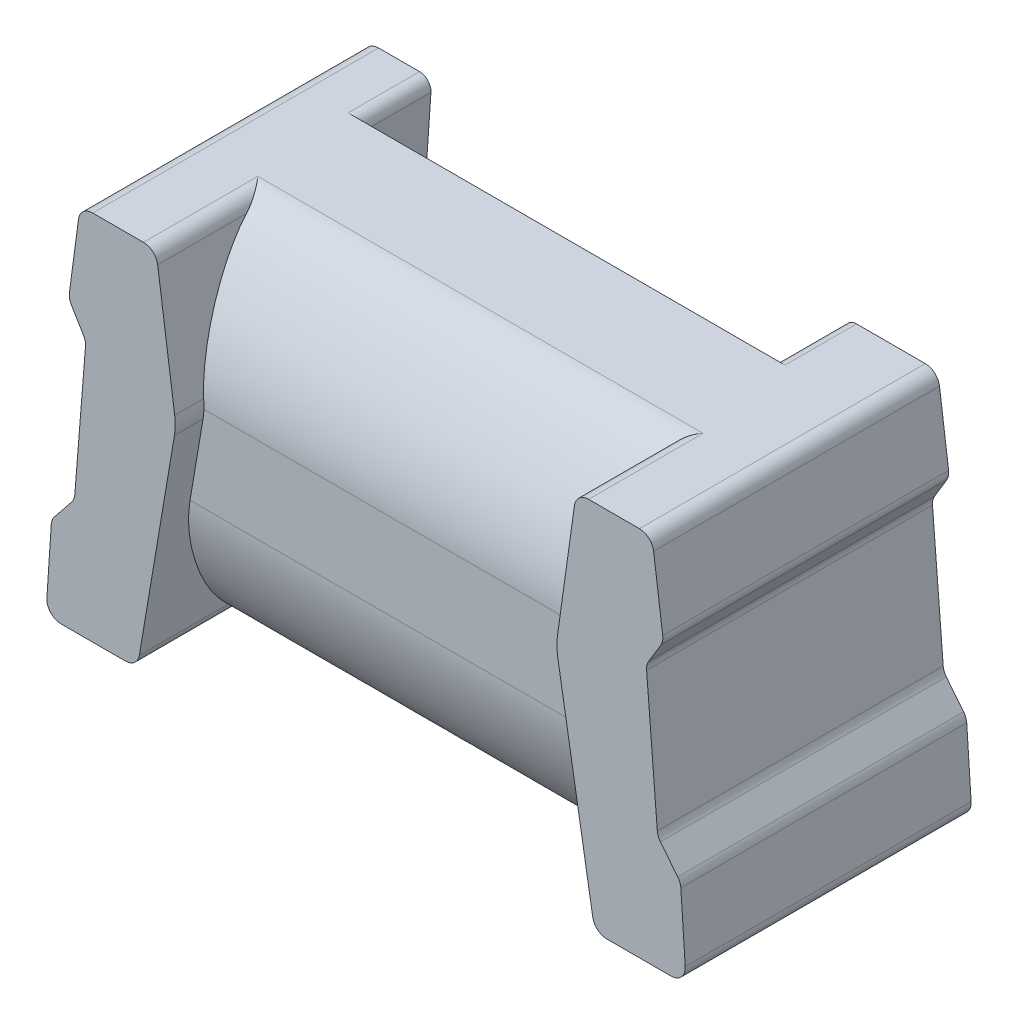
ISO-10303-21;
HEADER;
FILE_DESCRIPTION(('STEP AP214'),'2;1');
FILE_NAME('part.step','',(''),(''),'','','');
FILE_SCHEMA(('AUTOMOTIVE_DESIGN { 1 0 10303 214 1 1 1 1 }'));
ENDSEC;
DATA;
#1=APPLICATION_CONTEXT('core data for automotive mechanical design processes');
#2=APPLICATION_PROTOCOL_DEFINITION('international standard','automotive_design',2000,#1);
#3=PRODUCT_CONTEXT('',#1,'mechanical');
#4=PRODUCT('Part','Part','',(#3));
#5=PRODUCT_RELATED_PRODUCT_CATEGORY('part','',(#4));
#6=PRODUCT_DEFINITION_FORMATION('','',#4);
#7=PRODUCT_DEFINITION_CONTEXT('part definition',#1,'design');
#8=PRODUCT_DEFINITION('design','',#6,#7);
#9=PRODUCT_DEFINITION_SHAPE('','',#8);
#10=(LENGTH_UNIT() NAMED_UNIT(*) SI_UNIT(.MILLI.,.METRE.));
#11=(NAMED_UNIT(*) PLANE_ANGLE_UNIT() SI_UNIT($,.RADIAN.));
#12=(NAMED_UNIT(*) SI_UNIT($,.STERADIAN.) SOLID_ANGLE_UNIT());
#13=UNCERTAINTY_MEASURE_WITH_UNIT(LENGTH_MEASURE(1.E-05),#10,'distance_accuracy_value','');
#14=(GEOMETRIC_REPRESENTATION_CONTEXT(3) GLOBAL_UNCERTAINTY_ASSIGNED_CONTEXT((#13)) GLOBAL_UNIT_ASSIGNED_CONTEXT((#10,
#11,#12)) REPRESENTATION_CONTEXT('',''));
#15=CARTESIAN_POINT('',(0.,0.,0.));
#16=DIRECTION('',(0.,0.,1.));
#17=DIRECTION('',(1.,0.,0.));
#18=AXIS2_PLACEMENT_3D('',#15,#16,#17);
#19=CARTESIAN_POINT('',(0.,0.,0.));
#20=DIRECTION('',(0.,0.,1.));
#21=DIRECTION('',(1.,0.,0.));
#22=AXIS2_PLACEMENT_3D('',#19,#20,#21);
#23=PLANE('',#22);
#24=DIRECTION('',(-0.0291034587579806,0.999576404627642,0.));
#25=VECTOR('',#24,1.);
#26=CARTESIAN_POINT('',(4.,0.,0.));
#27=LINE('',#26,#25);
#28=CARTESIAN_POINT('',(3.98801473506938,0.411641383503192,0.));
#29=VERTEX_POINT('',#28);
#30=CARTESIAN_POINT('',(3.94810704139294,1.78229596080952,0.));
#31=VERTEX_POINT('',#30);
#32=EDGE_CURVE('E1149',#29,#31,#27,.T.);
#33=ORIENTED_EDGE('',*,*,#32,.F.);
#34=CARTESIAN_POINT('',(3.58818417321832,0.4,0.));
#35=DIRECTION('',(0.,0.,1.));
#36=DIRECTION('',(1.,0.,0.));
#37=AXIS2_PLACEMENT_3D('',#34,#35,#36);
#38=CIRCLE('',#37,0.4);
#39=CARTESIAN_POINT('',(3.58818417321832,0.,0.));
#40=VERTEX_POINT('',#39);
#41=EDGE_CURVE('E991',#29,#40,#38,.F.);
#42=ORIENTED_EDGE('',*,*,#41,.T.);
#43=DIRECTION('',(1.,0.,0.));
#44=VECTOR('',#43,1.);
#45=CARTESIAN_POINT('',(0.,0.,0.));
#46=LINE('',#45,#44);
#47=CARTESIAN_POINT('',(0.53444321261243,0.,0.));
#48=VERTEX_POINT('',#47);
#49=EDGE_CURVE('E837',#48,#40,#46,.T.);
#50=ORIENTED_EDGE('',*,*,#49,.F.);
#51=CARTESIAN_POINT('',(0.53444321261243,0.5,0.));
#52=DIRECTION('',(0.,0.,1.));
#53=DIRECTION('',(1.,0.,0.));
#54=AXIS2_PLACEMENT_3D('',#51,#52,#53);
#55=CIRCLE('',#54,0.5);
#56=CARTESIAN_POINT('',(0.0355506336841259,0.533259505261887,0.));
#57=VERTEX_POINT('',#56);
#58=EDGE_CURVE('E1092',#48,#57,#55,.F.);
#59=ORIENTED_EDGE('',*,*,#58,.T.);
#60=DIRECTION('',(-0.0665190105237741,-0.997785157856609,0.));
#61=VECTOR('',#60,1.);
#62=CARTESIAN_POINT('',(0.,0.,0.));
#63=LINE('',#62,#61);
#64=CARTESIAN_POINT('',(0.189562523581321,2.84343785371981,0.));
#65=VERTEX_POINT('',#64);
#66=EDGE_CURVE('E796',#65,#57,#63,.T.);
#67=ORIENTED_EDGE('',*,*,#66,.F.);
#68=CARTESIAN_POINT('',(0.688455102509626,2.81017834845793,0.));
#69=DIRECTION('',(0.,0.,1.));
#70=DIRECTION('',(1.,0.,0.));
#71=AXIS2_PLACEMENT_3D('',#68,#69,#70);
#72=CIRCLE('',#71,0.5);
#73=CARTESIAN_POINT('',(0.298020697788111,3.12252587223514,0.));
#74=VERTEX_POINT('',#73);
#75=EDGE_CURVE('E882',#65,#74,#72,.F.);
#76=ORIENTED_EDGE('',*,*,#75,.T.);
#77=DIRECTION('',(-0.624695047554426,-0.780868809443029,0.));
#78=VECTOR('',#77,1.);
#79=CARTESIAN_POINT('',(0.200000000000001,3.,0.));
#80=LINE('',#79,#78);
#81=CARTESIAN_POINT('',(0.904249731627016,3.88031216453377,0.));
#82=VERTEX_POINT('',#81);
#83=EDGE_CURVE('E800',#82,#74,#80,.T.);
#84=ORIENTED_EDGE('',*,*,#83,.F.);
#85=CARTESIAN_POINT('',(0.513815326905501,4.19265968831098,0.));
#86=DIRECTION('',(0.,0.,1.));
#87=DIRECTION('',(1.,0.,0.));
#88=AXIS2_PLACEMENT_3D('',#85,#86,#87);
#89=CIRCLE('',#88,0.5);
#90=CARTESIAN_POINT('',(1.01222296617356,4.15278707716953,0.));
#91=VERTEX_POINT('',#90);
#92=EDGE_CURVE('E952',#82,#91,#89,.T.);
#93=ORIENTED_EDGE('',*,*,#92,.T.);
#94=DIRECTION('',(-0.0797452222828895,-0.996815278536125,0.));
#95=VECTOR('',#94,1.);
#96=CARTESIAN_POINT('',(1.,4.,0.));
#97=LINE('',#96,#95);
#98=CARTESIAN_POINT('',(1.38722222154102,8.84027776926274,0.));
#99=VERTEX_POINT('',#98);
#100=EDGE_CURVE('E866',#99,#91,#97,.T.);
#101=ORIENTED_EDGE('',*,*,#100,.F.);
#102=CARTESIAN_POINT('',(0.888814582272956,8.88015038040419,0.));
#103=DIRECTION('',(0.,0.,1.));
#104=DIRECTION('',(1.,0.,0.));
#105=AXIS2_PLACEMENT_3D('',#102,#103,#104);
#106=CIRCLE('',#105,0.5);
#107=CARTESIAN_POINT('',(1.31756104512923,9.13739825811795,0.));
#108=VERTEX_POINT('',#107);
#109=EDGE_CURVE('E956',#99,#108,#106,.T.);
#110=ORIENTED_EDGE('',*,*,#109,.T.);
#111=DIRECTION('',(0.514495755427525,-0.857492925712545,0.));
#112=VECTOR('',#111,1.);
#113=CARTESIAN_POINT('',(1.4,9.,0.));
#114=LINE('',#113,#112);
#115=CARTESIAN_POINT('',(0.889982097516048,9.85002983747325,0.));
#116=VERTEX_POINT('',#115);
#117=EDGE_CURVE('E863',#116,#108,#114,.T.);
#118=ORIENTED_EDGE('',*,*,#117,.F.);
#119=CARTESIAN_POINT('',(1.31872856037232,10.107277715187,0.));
#120=DIRECTION('',(0.,0.,1.));
#121=DIRECTION('',(1.,0.,0.));
#122=AXIS2_PLACEMENT_3D('',#119,#120,#121);
#123=CIRCLE('',#122,0.5);
#124=CARTESIAN_POINT('',(0.823114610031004,10.1733595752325,0.));
#125=VERTEX_POINT('',#124);
#126=EDGE_CURVE('E1089',#116,#125,#123,.F.);
#127=ORIENTED_EDGE('',*,*,#126,.T.);
#128=DIRECTION('',(-0.132163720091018,-0.991227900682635,0.));
#129=VECTOR('',#128,1.);
#130=CARTESIAN_POINT('',(0.8,10.,0.));
#131=LINE('',#130,#129);
#132=CARTESIAN_POINT('',(1.14214424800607,12.5660818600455,0.));
#133=VERTEX_POINT('',#132);
#134=EDGE_CURVE('E860',#133,#125,#131,.T.);
#135=ORIENTED_EDGE('',*,*,#134,.F.);
#136=CARTESIAN_POINT('',(1.63775819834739,12.5,0.));
#137=DIRECTION('',(0.,0.,1.));
#138=DIRECTION('',(1.,0.,0.));
#139=AXIS2_PLACEMENT_3D('',#136,#137,#138);
#140=CIRCLE('',#139,0.5);
#141=CARTESIAN_POINT('',(1.63775819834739,13.,0.));
#142=VERTEX_POINT('',#141);
#143=EDGE_CURVE('E1086',#133,#142,#140,.F.);
#144=ORIENTED_EDGE('',*,*,#143,.T.);
#145=DIRECTION('',(-1.,0.,0.));
#146=VECTOR('',#145,1.);
#147=CARTESIAN_POINT('',(1.2,13.,0.));
#148=LINE('',#147,#146);
#149=CARTESIAN_POINT('',(3.07130244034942,13.,0.));
#150=VERTEX_POINT('',#149);
#151=EDGE_CURVE('E856',#150,#142,#148,.T.);
#152=ORIENTED_EDGE('',*,*,#151,.F.);
#153=CARTESIAN_POINT('',(3.07130244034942,12.6,0.));
#154=DIRECTION('',(0.,0.,1.));
#155=DIRECTION('',(1.,0.,0.));
#156=AXIS2_PLACEMENT_3D('',#153,#154,#155);
#157=CIRCLE('',#156,0.4);
#158=CARTESIAN_POINT('',(3.47034421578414,12.5723294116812,0.));
#159=VERTEX_POINT('',#158);
#160=EDGE_CURVE('E987',#150,#159,#157,.F.);
#161=ORIENTED_EDGE('',*,*,#160,.T.);
#162=DIRECTION('',(0.0691764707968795,0.997604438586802,0.));
#163=VECTOR('',#162,1.);
#164=CARTESIAN_POINT('',(2.7857713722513,2.7,0.));
#165=LINE('',#164,#163);
#166=CARTESIAN_POINT('',(2.80265169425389,2.94343369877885,0.));
#167=VERTEX_POINT('',#166);
#168=EDGE_CURVE('E1154',#167,#159,#165,.T.);
#169=ORIENTED_EDGE('',*,*,#168,.F.);
#170=CARTESIAN_POINT('',(3.20169346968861,2.9157631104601,0.));
#171=DIRECTION('',(0.,0.,1.));
#172=DIRECTION('',(1.,0.,0.));
#173=AXIS2_PLACEMENT_3D('',#170,#171,#172);
#174=CIRCLE('',#173,0.4);
#175=CARTESIAN_POINT('',(2.99450360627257,2.57360472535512,0.));
#176=VERTEX_POINT('',#175);
#177=EDGE_CURVE('E1026',#167,#176,#174,.T.);
#178=ORIENTED_EDGE('',*,*,#177,.T.);
#179=DIRECTION('',(-0.855395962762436,0.517974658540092,0.));
#180=VECTOR('',#179,1.);
#181=CARTESIAN_POINT('',(3.94176841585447,2.,0.));
#182=LINE('',#181,#180);
#183=CARTESIAN_POINT('',(3.75546634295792,2.11281296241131,0.));
#184=VERTEX_POINT('',#183);
#185=EDGE_CURVE('E1151',#184,#176,#182,.T.);
#186=ORIENTED_EDGE('',*,*,#185,.F.);
#187=CARTESIAN_POINT('',(3.54827647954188,1.77065457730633,0.));
#188=DIRECTION('',(0.,0.,1.));
#189=DIRECTION('',(1.,0.,0.));
#190=AXIS2_PLACEMENT_3D('',#187,#188,#189);
#191=CIRCLE('',#190,0.4);
#192=EDGE_CURVE('E989',#184,#31,#191,.F.);
#193=ORIENTED_EDGE('',*,*,#192,.T.);
#194=EDGE_LOOP('',(#33,#42,#50,#59,#67,#76,#84,#93,#101,#110,#118,#127,#135,#144,#152,#161,#169,
#178,#186,#193));
#195=FACE_BOUND('',#194,.T.);
#196=ADVANCED_FACE('F41',(#195),#23,.F.);
#197=CARTESIAN_POINT('',(0.,0.,10.));
#198=DIRECTION('',(0.,0.,1.));
#199=DIRECTION('',(1.,0.,0.));
#200=AXIS2_PLACEMENT_3D('',#197,#198,#199);
#201=PLANE('',#200);
#202=DIRECTION('',(1.,0.,0.));
#203=VECTOR('',#202,1.);
#204=CARTESIAN_POINT('',(0.,0.,10.));
#205=LINE('',#204,#203);
#206=CARTESIAN_POINT('',(0.53444321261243,0.,10.));
#207=VERTEX_POINT('',#206);
#208=CARTESIAN_POINT('',(2.77730583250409,0.,10.));
#209=VERTEX_POINT('',#208);
#210=EDGE_CURVE('E795',#207,#209,#205,.T.);
#211=ORIENTED_EDGE('',*,*,#210,.T.);
#212=CARTESIAN_POINT('',(2.77730583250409,0.5,10.));
#213=DIRECTION('',(0.,0.,1.));
#214=DIRECTION('',(1.,0.,0.));
#215=AXIS2_PLACEMENT_3D('',#212,#213,#214);
#216=CIRCLE('',#215,0.5);
#217=CARTESIAN_POINT('',(3.27033521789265,0.416801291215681,10.));
#218=VERTEX_POINT('',#217);
#219=EDGE_CURVE('E603',#209,#218,#216,.T.);
#220=ORIENTED_EDGE('',*,*,#219,.T.);
#221=DIRECTION('',(-0.166397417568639,-0.986058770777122,0.));
#222=VECTOR('',#221,1.);
#223=CARTESIAN_POINT('',(4.55,8.,10.));
#224=LINE('',#223,#222);
#225=CARTESIAN_POINT('',(4.49863516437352,7.6956157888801,10.));
#226=VERTEX_POINT('',#225);
#227=EDGE_CURVE('E1139',#226,#218,#224,.T.);
#228=ORIENTED_EDGE('',*,*,#227,.F.);
#229=CARTESIAN_POINT('',(2.52651762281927,8.02841062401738,10.));
#230=DIRECTION('',(0.,0.,1.));
#231=DIRECTION('',(1.,0.,0.));
#232=AXIS2_PLACEMENT_3D('',#229,#230,#231);
#233=CIRCLE('',#232,2.);
#234=CARTESIAN_POINT('',(4.50720111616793,8.30570631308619,10.));
#235=VERTEX_POINT('',#234);
#236=EDGE_CURVE('E1168',#226,#235,#233,.T.);
#237=ORIENTED_EDGE('',*,*,#236,.T.);
#238=DIRECTION('',(0.138647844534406,-0.99034174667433,0.));
#239=VECTOR('',#238,1.);
#240=CARTESIAN_POINT('',(3.85,13.,10.));
#241=LINE('',#240,#239);
#242=CARTESIAN_POINT('',(3.91029465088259,12.5693239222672,10.));
#243=VERTEX_POINT('',#242);
#244=EDGE_CURVE('E804',#243,#235,#241,.T.);
#245=ORIENTED_EDGE('',*,*,#244,.F.);
#246=CARTESIAN_POINT('',(3.41512377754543,12.5,10.));
#247=DIRECTION('',(0.,0.,1.));
#248=DIRECTION('',(1.,0.,0.));
#249=AXIS2_PLACEMENT_3D('',#246,#247,#248);
#250=CIRCLE('',#249,0.5);
#251=CARTESIAN_POINT('',(3.41512377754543,13.,10.));
#252=VERTEX_POINT('',#251);
#253=EDGE_CURVE('E544',#243,#252,#250,.T.);
#254=ORIENTED_EDGE('',*,*,#253,.T.);
#255=DIRECTION('',(-1.,0.,0.));
#256=VECTOR('',#255,1.);
#257=CARTESIAN_POINT('',(1.2,13.,10.));
#258=LINE('',#257,#256);
#259=CARTESIAN_POINT('',(1.63775819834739,13.,10.));
#260=VERTEX_POINT('',#259);
#261=EDGE_CURVE('E538',#252,#260,#258,.T.);
#262=ORIENTED_EDGE('',*,*,#261,.T.);
#263=CARTESIAN_POINT('',(1.63775819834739,12.5,10.));
#264=DIRECTION('',(0.,0.,1.));
#265=DIRECTION('',(1.,0.,0.));
#266=AXIS2_PLACEMENT_3D('',#263,#264,#265);
#267=CIRCLE('',#266,0.5);
#268=CARTESIAN_POINT('',(1.14214424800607,12.5660818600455,10.));
#269=VERTEX_POINT('',#268);
#270=EDGE_CURVE('E1098',#260,#269,#267,.T.);
#271=ORIENTED_EDGE('',*,*,#270,.T.);
#272=DIRECTION('',(-0.132163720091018,-0.991227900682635,0.));
#273=VECTOR('',#272,1.);
#274=CARTESIAN_POINT('',(0.8,10.,10.));
#275=LINE('',#274,#273);
#276=CARTESIAN_POINT('',(0.823114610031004,10.1733595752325,10.));
#277=VERTEX_POINT('',#276);
#278=EDGE_CURVE('E823',#269,#277,#275,.T.);
#279=ORIENTED_EDGE('',*,*,#278,.T.);
#280=CARTESIAN_POINT('',(1.31872856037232,10.107277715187,10.));
#281=DIRECTION('',(0.,0.,1.));
#282=DIRECTION('',(1.,0.,0.));
#283=AXIS2_PLACEMENT_3D('',#280,#281,#282);
#284=CIRCLE('',#283,0.5);
#285=CARTESIAN_POINT('',(0.889982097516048,9.85002983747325,10.));
#286=VERTEX_POINT('',#285);
#287=EDGE_CURVE('E1100',#277,#286,#284,.T.);
#288=ORIENTED_EDGE('',*,*,#287,.T.);
#289=DIRECTION('',(0.514495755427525,-0.857492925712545,0.));
#290=VECTOR('',#289,1.);
#291=CARTESIAN_POINT('',(1.4,9.,10.));
#292=LINE('',#291,#290);
#293=CARTESIAN_POINT('',(1.31756104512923,9.13739825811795,10.));
#294=VERTEX_POINT('',#293);
#295=EDGE_CURVE('E826',#286,#294,#292,.T.);
#296=ORIENTED_EDGE('',*,*,#295,.T.);
#297=CARTESIAN_POINT('',(0.888814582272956,8.88015038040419,10.));
#298=DIRECTION('',(0.,0.,1.));
#299=DIRECTION('',(1.,0.,0.));
#300=AXIS2_PLACEMENT_3D('',#297,#298,#299);
#301=CIRCLE('',#300,0.5);
#302=CARTESIAN_POINT('',(1.38722222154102,8.84027776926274,10.));
#303=VERTEX_POINT('',#302);
#304=EDGE_CURVE('E958',#294,#303,#301,.F.);
#305=ORIENTED_EDGE('',*,*,#304,.T.);
#306=DIRECTION('',(-0.0797452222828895,-0.996815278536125,0.));
#307=VECTOR('',#306,1.);
#308=CARTESIAN_POINT('',(1.,4.,10.));
#309=LINE('',#308,#307);
#310=CARTESIAN_POINT('',(1.01222296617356,4.15278707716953,10.));
#311=VERTEX_POINT('',#310);
#312=EDGE_CURVE('E829',#303,#311,#309,.T.);
#313=ORIENTED_EDGE('',*,*,#312,.T.);
#314=CARTESIAN_POINT('',(0.513815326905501,4.19265968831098,10.));
#315=DIRECTION('',(0.,0.,1.));
#316=DIRECTION('',(1.,0.,0.));
#317=AXIS2_PLACEMENT_3D('',#314,#315,#316);
#318=CIRCLE('',#317,0.5);
#319=CARTESIAN_POINT('',(0.904249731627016,3.88031216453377,10.));
#320=VERTEX_POINT('',#319);
#321=EDGE_CURVE('E954',#311,#320,#318,.F.);
#322=ORIENTED_EDGE('',*,*,#321,.T.);
#323=DIRECTION('',(-0.624695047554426,-0.780868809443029,0.));
#324=VECTOR('',#323,1.);
#325=CARTESIAN_POINT('',(0.200000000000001,3.,10.));
#326=LINE('',#325,#324);
#327=CARTESIAN_POINT('',(0.298020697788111,3.12252587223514,10.));
#328=VERTEX_POINT('',#327);
#329=EDGE_CURVE('E832',#320,#328,#326,.T.);
#330=ORIENTED_EDGE('',*,*,#329,.T.);
#331=CARTESIAN_POINT('',(0.688455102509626,2.81017834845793,10.));
#332=DIRECTION('',(0.,0.,1.));
#333=DIRECTION('',(1.,0.,0.));
#334=AXIS2_PLACEMENT_3D('',#331,#332,#333);
#335=CIRCLE('',#334,0.5);
#336=CARTESIAN_POINT('',(0.189562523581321,2.84343785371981,10.));
#337=VERTEX_POINT('',#336);
#338=EDGE_CURVE('E884',#328,#337,#335,.T.);
#339=ORIENTED_EDGE('',*,*,#338,.T.);
#340=DIRECTION('',(-0.0665190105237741,-0.997785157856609,0.));
#341=VECTOR('',#340,1.);
#342=CARTESIAN_POINT('',(0.,0.,10.));
#343=LINE('',#342,#341);
#344=CARTESIAN_POINT('',(0.0355506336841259,0.533259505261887,10.));
#345=VERTEX_POINT('',#344);
#346=EDGE_CURVE('E426',#337,#345,#343,.T.);
#347=ORIENTED_EDGE('',*,*,#346,.T.);
#348=CARTESIAN_POINT('',(0.53444321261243,0.5,10.));
#349=DIRECTION('',(0.,0.,1.));
#350=DIRECTION('',(1.,0.,0.));
#351=AXIS2_PLACEMENT_3D('',#348,#349,#350);
#352=CIRCLE('',#351,0.5);
#353=EDGE_CURVE('E890',#345,#207,#352,.T.);
#354=ORIENTED_EDGE('',*,*,#353,.T.);
#355=EDGE_LOOP('',(#211,#220,#228,#237,#245,#254,#262,#271,#279,#288,#296,#305,#313,#322,#330,
#339,#347,#354));
#356=FACE_BOUND('',#355,.T.);
#357=ADVANCED_FACE('F662',(#356),#201,.T.);
#358=CARTESIAN_POINT('',(0.,0.,10.));
#359=DIRECTION('',(0.,1.,0.));
#360=DIRECTION('',(0.,0.,1.));
#361=AXIS2_PLACEMENT_3D('',#358,#359,#360);
#362=PLANE('',#361);
#363=CARTESIAN_POINT('',(19.6226941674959,0.,10.));
#364=VERTEX_POINT('',#363);
#365=CARTESIAN_POINT('',(21.8655567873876,0.,10.));
#366=VERTEX_POINT('',#365);
#367=EDGE_CURVE('E788',#364,#366,#205,.T.);
#368=ORIENTED_EDGE('',*,*,#367,.F.);
#369=DIRECTION('',(0.,0.,1.));
#370=VECTOR('',#369,1.);
#371=CARTESIAN_POINT('',(19.6226941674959,0.,10.));
#372=LINE('',#371,#370);
#373=CARTESIAN_POINT('',(19.6226941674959,0.,6.));
#374=VERTEX_POINT('',#373);
#375=EDGE_CURVE('E606',#364,#374,#372,.F.);
#376=ORIENTED_EDGE('',*,*,#375,.T.);
#377=CARTESIAN_POINT('',(2.4,0.,6.));
#378=CARTESIAN_POINT('',(8.26666666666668,0.,6.));
#379=CARTESIAN_POINT('',(14.1333333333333,0.,6.));
#380=CARTESIAN_POINT('',(20.,0.,6.));
#381=(BOUNDED_CURVE() B_SPLINE_CURVE(3,(#377,#378,#379,#380),.UNSPECIFIED.,.F.,
.F.) B_SPLINE_CURVE_WITH_KNOTS((4,4),(-0.02,-0.0024),
.UNSPECIFIED.) CURVE() GEOMETRIC_REPRESENTATION_ITEM() RATIONAL_B_SPLINE_CURVE((1.,1.,1.,1.)) REPRESENTATION_ITEM(''));
#382=CARTESIAN_POINT('',(19.2,0.,6.));
#383=VERTEX_POINT('',#382);
#384=EDGE_CURVE('E604',#374,#383,#381,.F.);
#385=ORIENTED_EDGE('',*,*,#384,.T.);
#386=CARTESIAN_POINT('',(2.4,0.,6.));
#387=CARTESIAN_POINT('',(8.26666666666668,0.,6.));
#388=CARTESIAN_POINT('',(14.1333333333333,0.,6.));
#389=CARTESIAN_POINT('',(20.,0.,6.));
#390=(BOUNDED_CURVE() B_SPLINE_CURVE(3,(#386,#387,#388,#389),.UNSPECIFIED.,.F.,
.F.) B_SPLINE_CURVE_WITH_KNOTS((4,4),(-0.02,-0.0024),
.UNSPECIFIED.) CURVE() GEOMETRIC_REPRESENTATION_ITEM() RATIONAL_B_SPLINE_CURVE((1.,1.,1.,1.)) REPRESENTATION_ITEM(''));
#391=CARTESIAN_POINT('',(3.2,0.,6.));
#392=VERTEX_POINT('',#391);
#393=EDGE_CURVE('E598',#383,#392,#390,.F.);
#394=ORIENTED_EDGE('',*,*,#393,.T.);
#395=CARTESIAN_POINT('',(2.4,0.,6.));
#396=CARTESIAN_POINT('',(8.26666666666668,0.,6.));
#397=CARTESIAN_POINT('',(14.1333333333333,0.,6.));
#398=CARTESIAN_POINT('',(20.,0.,6.));
#399=(BOUNDED_CURVE() B_SPLINE_CURVE(3,(#395,#396,#397,#398),.UNSPECIFIED.,.F.,
.F.) B_SPLINE_CURVE_WITH_KNOTS((4,4),(-0.02,-0.0024),
.UNSPECIFIED.) CURVE() GEOMETRIC_REPRESENTATION_ITEM() RATIONAL_B_SPLINE_CURVE((1.,1.,1.,1.)) REPRESENTATION_ITEM(''));
#400=CARTESIAN_POINT('',(2.77730583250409,0.,6.));
#401=VERTEX_POINT('',#400);
#402=EDGE_CURVE('E70',#392,#401,#399,.F.);
#403=ORIENTED_EDGE('',*,*,#402,.T.);
#404=DIRECTION('',(0.,0.,1.));
#405=VECTOR('',#404,1.);
#406=CARTESIAN_POINT('',(2.77730583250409,0.,10.));
#407=LINE('',#406,#405);
#408=EDGE_CURVE('E596',#401,#209,#407,.T.);
#409=ORIENTED_EDGE('',*,*,#408,.T.);
#410=ORIENTED_EDGE('',*,*,#210,.F.);
#411=DIRECTION('',(0.,0.,-1.));
#412=VECTOR('',#411,1.);
#413=CARTESIAN_POINT('',(0.53444321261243,0.,10.));
#414=LINE('',#413,#412);
#415=EDGE_CURVE('E1083',#207,#48,#414,.T.);
#416=ORIENTED_EDGE('',*,*,#415,.T.);
#417=ORIENTED_EDGE('',*,*,#49,.T.);
#418=DIRECTION('',(0.,0.,-1.));
#419=VECTOR('',#418,1.);
#420=CARTESIAN_POINT('',(3.58818417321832,0.,10.));
#421=LINE('',#420,#419);
#422=CARTESIAN_POINT('',(3.58818417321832,0.,2.5));
#423=VERTEX_POINT('',#422);
#424=EDGE_CURVE('E996',#40,#423,#421,.F.);
#425=ORIENTED_EDGE('',*,*,#424,.T.);
#426=DIRECTION('',(-1.,0.,0.));
#427=VECTOR('',#426,1.);
#428=CARTESIAN_POINT('',(17.5,0.,2.5));
#429=LINE('',#428,#427);
#430=CARTESIAN_POINT('',(17.8932458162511,0.,2.5));
#431=VERTEX_POINT('',#430);
#432=EDGE_CURVE('E1124',#431,#423,#429,.T.);
#433=ORIENTED_EDGE('',*,*,#432,.F.);
#434=DIRECTION('',(0.,0.,-1.));
#435=VECTOR('',#434,1.);
#436=CARTESIAN_POINT('',(17.8932458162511,0.,10.));
#437=LINE('',#436,#435);
#438=CARTESIAN_POINT('',(17.8932458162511,0.,0.));
#439=VERTEX_POINT('',#438);
#440=EDGE_CURVE('E993',#431,#439,#437,.T.);
#441=ORIENTED_EDGE('',*,*,#440,.T.);
#442=CARTESIAN_POINT('',(21.8655567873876,0.,0.));
#443=VERTEX_POINT('',#442);
#444=EDGE_CURVE('E841',#439,#443,#46,.T.);
#445=ORIENTED_EDGE('',*,*,#444,.T.);
#446=DIRECTION('',(0.,0.,-1.));
#447=VECTOR('',#446,1.);
#448=CARTESIAN_POINT('',(21.8655567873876,0.,10.));
#449=LINE('',#448,#447);
#450=EDGE_CURVE('E793',#443,#366,#449,.F.);
#451=ORIENTED_EDGE('',*,*,#450,.T.);
#452=EDGE_LOOP('',(#368,#376,#385,#394,#403,#409,#410,#416,#417,#425,#433,#441,#445,#451));
#453=FACE_BOUND('',#452,.T.);
#454=ADVANCED_FACE('F453',(#453),#362,.F.);
#455=CARTESIAN_POINT('',(22.4,0.,10.));
#456=DIRECTION('',(-0.997785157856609,-0.0665190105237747,0.));
#457=DIRECTION('',(0.0665190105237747,-0.997785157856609,0.));
#458=AXIS2_PLACEMENT_3D('',#455,#456,#457);
#459=PLANE('',#458);
#460=DIRECTION('',(-0.0665190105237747,0.997785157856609,0.));
#461=VECTOR('',#460,1.);
#462=CARTESIAN_POINT('',(22.4,0.,10.));
#463=LINE('',#462,#461);
#464=CARTESIAN_POINT('',(22.3644493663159,0.533259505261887,10.));
#465=VERTEX_POINT('',#464);
#466=CARTESIAN_POINT('',(22.2104374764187,2.84343785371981,10.));
#467=VERTEX_POINT('',#466);
#468=EDGE_CURVE('E798',#465,#467,#463,.T.);
#469=ORIENTED_EDGE('',*,*,#468,.F.);
#470=DIRECTION('',(0.,0.,-1.));
#471=VECTOR('',#470,1.);
#472=CARTESIAN_POINT('',(22.3644493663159,0.533259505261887,10.));
#473=LINE('',#472,#471);
#474=CARTESIAN_POINT('',(22.3644493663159,0.533259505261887,0.));
#475=VERTEX_POINT('',#474);
#476=EDGE_CURVE('E934',#465,#475,#473,.T.);
#477=ORIENTED_EDGE('',*,*,#476,.T.);
#478=DIRECTION('',(-0.0665190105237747,0.997785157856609,0.));
#479=VECTOR('',#478,1.);
#480=CARTESIAN_POINT('',(22.4,0.,0.));
#481=LINE('',#480,#479);
#482=CARTESIAN_POINT('',(22.2104374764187,2.84343785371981,0.));
#483=VERTEX_POINT('',#482);
#484=EDGE_CURVE('E840',#475,#483,#481,.T.);
#485=ORIENTED_EDGE('',*,*,#484,.T.);
#486=DIRECTION('',(0.,0.,-1.));
#487=VECTOR('',#486,1.);
#488=CARTESIAN_POINT('',(22.2104374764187,2.84343785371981,10.));
#489=LINE('',#488,#487);
#490=EDGE_CURVE('E932',#483,#467,#489,.F.);
#491=ORIENTED_EDGE('',*,*,#490,.T.);
#492=EDGE_LOOP('',(#469,#477,#485,#491));
#493=FACE_BOUND('',#492,.T.);
#494=ADVANCED_FACE('F1244',(#493),#459,.F.);
#495=CARTESIAN_POINT('',(22.2,3.,10.));
#496=DIRECTION('',(-0.78086880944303,-0.624695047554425,0.));
#497=DIRECTION('',(0.624695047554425,-0.78086880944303,0.));
#498=AXIS2_PLACEMENT_3D('',#495,#496,#497);
#499=PLANE('',#498);
#500=DIRECTION('',(-0.624695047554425,0.78086880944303,0.));
#501=VECTOR('',#500,1.);
#502=CARTESIAN_POINT('',(22.2,3.,10.));
#503=LINE('',#502,#501);
#504=CARTESIAN_POINT('',(22.1019793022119,3.12252587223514,10.));
#505=VERTEX_POINT('',#504);
#506=CARTESIAN_POINT('',(21.495750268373,3.88031216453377,10.));
#507=VERTEX_POINT('',#506);
#508=EDGE_CURVE('E808',#505,#507,#503,.T.);
#509=ORIENTED_EDGE('',*,*,#508,.F.);
#510=DIRECTION('',(0.,0.,-1.));
#511=VECTOR('',#510,1.);
#512=CARTESIAN_POINT('',(22.1019793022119,3.12252587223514,10.));
#513=LINE('',#512,#511);
#514=CARTESIAN_POINT('',(22.1019793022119,3.12252587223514,0.));
#515=VERTEX_POINT('',#514);
#516=EDGE_CURVE('E939',#505,#515,#513,.T.);
#517=ORIENTED_EDGE('',*,*,#516,.T.);
#518=DIRECTION('',(-0.624695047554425,0.78086880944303,0.));
#519=VECTOR('',#518,1.);
#520=CARTESIAN_POINT('',(22.2,3.,0.));
#521=LINE('',#520,#519);
#522=CARTESIAN_POINT('',(21.495750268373,3.88031216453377,0.));
#523=VERTEX_POINT('',#522);
#524=EDGE_CURVE('E844',#515,#523,#521,.T.);
#525=ORIENTED_EDGE('',*,*,#524,.T.);
#526=DIRECTION('',(0.,0.,-1.));
#527=VECTOR('',#526,1.);
#528=CARTESIAN_POINT('',(21.495750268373,3.88031216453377,10.));
#529=LINE('',#528,#527);
#530=EDGE_CURVE('E937',#523,#507,#529,.F.);
#531=ORIENTED_EDGE('',*,*,#530,.T.);
#532=EDGE_LOOP('',(#509,#517,#525,#531));
#533=FACE_BOUND('',#532,.T.);
#534=ADVANCED_FACE('F1235',(#533),#499,.F.);
#535=CARTESIAN_POINT('',(21.4,4.,10.));
#536=DIRECTION('',(-0.996815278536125,-0.0797452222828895,0.));
#537=DIRECTION('',(0.0797452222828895,-0.996815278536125,0.));
#538=AXIS2_PLACEMENT_3D('',#535,#536,#537);
#539=PLANE('',#538);
#540=DIRECTION('',(-0.0797452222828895,0.996815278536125,0.));
#541=VECTOR('',#540,1.);
#542=CARTESIAN_POINT('',(21.4,4.,10.));
#543=LINE('',#542,#541);
#544=CARTESIAN_POINT('',(21.3877770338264,4.15278707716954,10.));
#545=VERTEX_POINT('',#544);
#546=CARTESIAN_POINT('',(21.012777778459,8.84027776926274,10.));
#547=VERTEX_POINT('',#546);
#548=EDGE_CURVE('E811',#545,#547,#543,.T.);
#549=ORIENTED_EDGE('',*,*,#548,.F.);
#550=DIRECTION('',(0.,0.,-1.));
#551=VECTOR('',#550,1.);
#552=CARTESIAN_POINT('',(21.3877770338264,4.15278707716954,0.));
#553=LINE('',#552,#551);
#554=CARTESIAN_POINT('',(21.3877770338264,4.15278707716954,0.));
#555=VERTEX_POINT('',#554);
#556=EDGE_CURVE('E944',#545,#555,#553,.T.);
#557=ORIENTED_EDGE('',*,*,#556,.T.);
#558=DIRECTION('',(-0.0797452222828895,0.996815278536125,0.));
#559=VECTOR('',#558,1.);
#560=CARTESIAN_POINT('',(21.4,4.,0.));
#561=LINE('',#560,#559);
#562=CARTESIAN_POINT('',(21.012777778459,8.84027776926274,0.));
#563=VERTEX_POINT('',#562);
#564=EDGE_CURVE('E847',#555,#563,#561,.T.);
#565=ORIENTED_EDGE('',*,*,#564,.T.);
#566=DIRECTION('',(0.,0.,-1.));
#567=VECTOR('',#566,1.);
#568=CARTESIAN_POINT('',(21.012777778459,8.84027776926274,10.));
#569=LINE('',#568,#567);
#570=EDGE_CURVE('E942',#563,#547,#569,.F.);
#571=ORIENTED_EDGE('',*,*,#570,.T.);
#572=EDGE_LOOP('',(#549,#557,#565,#571));
#573=FACE_BOUND('',#572,.T.);
#574=ADVANCED_FACE('F1226',(#573),#539,.F.);
#575=CARTESIAN_POINT('',(21.,9.,10.));
#576=DIRECTION('',(-0.857492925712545,0.514495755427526,0.));
#577=DIRECTION('',(-0.514495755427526,-0.857492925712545,0.));
#578=AXIS2_PLACEMENT_3D('',#575,#576,#577);
#579=PLANE('',#578);
#580=DIRECTION('',(0.514495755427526,0.857492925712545,0.));
#581=VECTOR('',#580,1.);
#582=CARTESIAN_POINT('',(21.,9.,10.));
#583=LINE('',#582,#581);
#584=CARTESIAN_POINT('',(21.0824389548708,9.13739825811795,10.));
#585=VERTEX_POINT('',#584);
#586=CARTESIAN_POINT('',(21.510017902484,9.85002983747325,10.));
#587=VERTEX_POINT('',#586);
#588=EDGE_CURVE('E814',#585,#587,#583,.T.);
#589=ORIENTED_EDGE('',*,*,#588,.F.);
#590=DIRECTION('',(0.,0.,-1.));
#591=VECTOR('',#590,1.);
#592=CARTESIAN_POINT('',(21.0824389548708,9.13739825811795,0.));
#593=LINE('',#592,#591);
#594=CARTESIAN_POINT('',(21.0824389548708,9.13739825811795,0.));
#595=VERTEX_POINT('',#594);
#596=EDGE_CURVE('E949',#585,#595,#593,.T.);
#597=ORIENTED_EDGE('',*,*,#596,.T.);
#598=DIRECTION('',(0.514495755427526,0.857492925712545,0.));
#599=VECTOR('',#598,1.);
#600=CARTESIAN_POINT('',(21.,9.,0.));
#601=LINE('',#600,#599);
#602=CARTESIAN_POINT('',(21.510017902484,9.85002983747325,0.));
#603=VERTEX_POINT('',#602);
#604=EDGE_CURVE('E850',#595,#603,#601,.T.);
#605=ORIENTED_EDGE('',*,*,#604,.T.);
#606=DIRECTION('',(0.,0.,-1.));
#607=VECTOR('',#606,1.);
#608=CARTESIAN_POINT('',(21.510017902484,9.85002983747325,10.));
#609=LINE('',#608,#607);
#610=EDGE_CURVE('E947',#603,#587,#609,.F.);
#611=ORIENTED_EDGE('',*,*,#610,.T.);
#612=EDGE_LOOP('',(#589,#597,#605,#611));
#613=FACE_BOUND('',#612,.T.);
#614=ADVANCED_FACE('F1217',(#613),#579,.F.);
#615=CARTESIAN_POINT('',(21.6,10.,10.));
#616=DIRECTION('',(-0.991227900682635,-0.132163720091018,0.));
#617=DIRECTION('',(0.132163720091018,-0.991227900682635,0.));
#618=AXIS2_PLACEMENT_3D('',#615,#616,#617);
#619=PLANE('',#618);
#620=DIRECTION('',(-0.132163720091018,0.991227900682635,0.));
#621=VECTOR('',#620,1.);
#622=CARTESIAN_POINT('',(21.6,10.,0.));
#623=LINE('',#622,#621);
#624=CARTESIAN_POINT('',(21.576885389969,10.1733595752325,0.));
#625=VERTEX_POINT('',#624);
#626=CARTESIAN_POINT('',(21.2578557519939,12.5660818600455,0.));
#627=VERTEX_POINT('',#626);
#628=EDGE_CURVE('E853',#625,#627,#623,.T.);
#629=ORIENTED_EDGE('',*,*,#628,.T.);
#630=DIRECTION('',(0.,0.,-1.));
#631=VECTOR('',#630,1.);
#632=CARTESIAN_POINT('',(21.2578557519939,12.5660818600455,10.));
#633=LINE('',#632,#631);
#634=CARTESIAN_POINT('',(21.2578557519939,12.5660818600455,10.));
#635=VERTEX_POINT('',#634);
#636=EDGE_CURVE('E922',#627,#635,#633,.F.);
#637=ORIENTED_EDGE('',*,*,#636,.T.);
#638=DIRECTION('',(-0.132163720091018,0.991227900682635,0.));
#639=VECTOR('',#638,1.);
#640=CARTESIAN_POINT('',(21.6,10.,10.));
#641=LINE('',#640,#639);
#642=CARTESIAN_POINT('',(21.576885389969,10.1733595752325,10.));
#643=VERTEX_POINT('',#642);
#644=EDGE_CURVE('E817',#643,#635,#641,.T.);
#645=ORIENTED_EDGE('',*,*,#644,.F.);
#646=DIRECTION('',(0.,0.,-1.));
#647=VECTOR('',#646,1.);
#648=CARTESIAN_POINT('',(21.576885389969,10.1733595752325,10.));
#649=LINE('',#648,#647);
#650=EDGE_CURVE('E919',#643,#625,#649,.T.);
#651=ORIENTED_EDGE('',*,*,#650,.T.);
#652=EDGE_LOOP('',(#629,#637,#645,#651));
#653=FACE_BOUND('',#652,.T.);
#654=ADVANCED_FACE('F688',(#653),#619,.F.);
#655=CARTESIAN_POINT('',(1.2,13.,10.));
#656=DIRECTION('',(0.,-1.,0.));
#657=DIRECTION('',(0.,0.,-1.));
#658=AXIS2_PLACEMENT_3D('',#655,#656,#657);
#659=PLANE('',#658);
#660=CARTESIAN_POINT('',(19.285,13.,6.));
#661=CARTESIAN_POINT('',(13.895,13.,6.));
#662=CARTESIAN_POINT('',(8.505,13.,6.));
#663=CARTESIAN_POINT('',(3.115,13.,6.));
#664=(BOUNDED_CURVE() B_SPLINE_CURVE(3,(#660,#661,#662,#663),.UNSPECIFIED.,.F.,
.F.) B_SPLINE_CURVE_WITH_KNOTS((4,4),(0.003115,0.019285),
.UNSPECIFIED.) CURVE() GEOMETRIC_REPRESENTATION_ITEM() RATIONAL_B_SPLINE_CURVE((1.,1.,1.,1.)) REPRESENTATION_ITEM(''));
#665=CARTESIAN_POINT('',(18.55,13.,6.));
#666=VERTEX_POINT('',#665);
#667=CARTESIAN_POINT('',(18.9848762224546,13.,6.));
#668=VERTEX_POINT('',#667);
#669=EDGE_CURVE('E61',#666,#668,#664,.F.);
#670=ORIENTED_EDGE('',*,*,#669,.T.);
#671=DIRECTION('',(0.,0.,1.));
#672=VECTOR('',#671,1.);
#673=CARTESIAN_POINT('',(18.9848762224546,13.,10.));
#674=LINE('',#673,#672);
#675=CARTESIAN_POINT('',(18.9848762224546,13.,10.));
#676=VERTEX_POINT('',#675);
#677=EDGE_CURVE('E552',#668,#676,#674,.T.);
#678=ORIENTED_EDGE('',*,*,#677,.T.);
#679=CARTESIAN_POINT('',(20.7622418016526,13.,10.));
#680=VERTEX_POINT('',#679);
#681=EDGE_CURVE('E820',#680,#676,#258,.T.);
#682=ORIENTED_EDGE('',*,*,#681,.F.);
#683=DIRECTION('',(0.,0.,-1.));
#684=VECTOR('',#683,1.);
#685=CARTESIAN_POINT('',(20.7622418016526,13.,10.));
#686=LINE('',#685,#684);
#687=CARTESIAN_POINT('',(20.7622418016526,13.,0.));
#688=VERTEX_POINT('',#687);
#689=EDGE_CURVE('E905',#680,#688,#686,.T.);
#690=ORIENTED_EDGE('',*,*,#689,.T.);
#691=CARTESIAN_POINT('',(18.3550652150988,13.,0.));
#692=VERTEX_POINT('',#691);
#693=EDGE_CURVE('E857',#688,#692,#148,.T.);
#694=ORIENTED_EDGE('',*,*,#693,.T.);
#695=DIRECTION('',(0.,0.,-1.));
#696=VECTOR('',#695,1.);
#697=CARTESIAN_POINT('',(18.3550652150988,13.,10.));
#698=LINE('',#697,#696);
#699=CARTESIAN_POINT('',(18.3550652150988,13.,2.5));
#700=VERTEX_POINT('',#699);
#701=EDGE_CURVE('E999',#692,#700,#698,.F.);
#702=ORIENTED_EDGE('',*,*,#701,.T.);
#703=DIRECTION('',(1.,0.,0.));
#704=VECTOR('',#703,1.);
#705=CARTESIAN_POINT('',(3.5,13.,2.5));
#706=LINE('',#705,#704);
#707=CARTESIAN_POINT('',(3.07130244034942,13.,2.5));
#708=VERTEX_POINT('',#707);
#709=EDGE_CURVE('E1157',#708,#700,#706,.T.);
#710=ORIENTED_EDGE('',*,*,#709,.F.);
#711=DIRECTION('',(0.,0.,-1.));
#712=VECTOR('',#711,1.);
#713=CARTESIAN_POINT('',(3.07130244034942,13.,10.));
#714=LINE('',#713,#712);
#715=EDGE_CURVE('E1002',#708,#150,#714,.T.);
#716=ORIENTED_EDGE('',*,*,#715,.T.);
#717=ORIENTED_EDGE('',*,*,#151,.T.);
#718=DIRECTION('',(0.,0.,-1.));
#719=VECTOR('',#718,1.);
#720=CARTESIAN_POINT('',(1.63775819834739,13.,10.));
#721=LINE('',#720,#719);
#722=EDGE_CURVE('E908',#142,#260,#721,.F.);
#723=ORIENTED_EDGE('',*,*,#722,.T.);
#724=ORIENTED_EDGE('',*,*,#261,.F.);
#725=DIRECTION('',(0.,0.,1.));
#726=VECTOR('',#725,1.);
#727=CARTESIAN_POINT('',(3.41512377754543,13.,10.));
#728=LINE('',#727,#726);
#729=CARTESIAN_POINT('',(3.41512377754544,13.,6.));
#730=VERTEX_POINT('',#729);
#731=EDGE_CURVE('E532',#252,#730,#728,.F.);
#732=ORIENTED_EDGE('',*,*,#731,.T.);
#733=CARTESIAN_POINT('',(19.285,13.,6.));
#734=CARTESIAN_POINT('',(13.895,13.,6.));
#735=CARTESIAN_POINT('',(8.505,13.,6.));
#736=CARTESIAN_POINT('',(3.115,13.,6.));
#737=(BOUNDED_CURVE() B_SPLINE_CURVE(3,(#733,#734,#735,#736),.UNSPECIFIED.,.F.,
.F.) B_SPLINE_CURVE_WITH_KNOTS((4,4),(0.003115,0.019285),
.UNSPECIFIED.) CURVE() GEOMETRIC_REPRESENTATION_ITEM() RATIONAL_B_SPLINE_CURVE((1.,1.,1.,1.)) REPRESENTATION_ITEM(''));
#738=CARTESIAN_POINT('',(3.85,13.,6.));
#739=VERTEX_POINT('',#738);
#740=EDGE_CURVE('E525',#730,#739,#737,.F.);
#741=ORIENTED_EDGE('',*,*,#740,.T.);
#742=CARTESIAN_POINT('',(19.285,13.,6.));
#743=CARTESIAN_POINT('',(13.895,13.,6.));
#744=CARTESIAN_POINT('',(8.505,13.,6.));
#745=CARTESIAN_POINT('',(3.115,13.,6.));
#746=(BOUNDED_CURVE() B_SPLINE_CURVE(3,(#742,#743,#744,#745),.UNSPECIFIED.,.F.,
.F.) B_SPLINE_CURVE_WITH_KNOTS((4,4),(0.003115,0.019285),
.UNSPECIFIED.) CURVE() GEOMETRIC_REPRESENTATION_ITEM() RATIONAL_B_SPLINE_CURVE((1.,1.,1.,1.)) REPRESENTATION_ITEM(''));
#747=EDGE_CURVE('E425',#739,#666,#746,.F.);
#748=ORIENTED_EDGE('',*,*,#747,.T.);
#749=EDGE_LOOP('',(#670,#678,#682,#690,#694,#702,#710,#716,#717,#723,#724,#732,#741,#748));
#750=FACE_BOUND('',#749,.T.);
#751=ADVANCED_FACE('F536',(#750),#659,.F.);
#752=CARTESIAN_POINT('',(0.8,10.,10.));
#753=DIRECTION('',(0.991227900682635,-0.132163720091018,0.));
#754=DIRECTION('',(0.132163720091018,0.991227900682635,0.));
#755=AXIS2_PLACEMENT_3D('',#752,#753,#754);
#756=PLANE('',#755);
#757=ORIENTED_EDGE('',*,*,#134,.T.);
#758=DIRECTION('',(0.,0.,-1.));
#759=VECTOR('',#758,1.);
#760=CARTESIAN_POINT('',(0.823114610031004,10.1733595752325,10.));
#761=LINE('',#760,#759);
#762=EDGE_CURVE('E903',#125,#277,#761,.F.);
#763=ORIENTED_EDGE('',*,*,#762,.T.);
#764=ORIENTED_EDGE('',*,*,#278,.F.);
#765=DIRECTION('',(0.,0.,-1.));
#766=VECTOR('',#765,1.);
#767=CARTESIAN_POINT('',(1.14214424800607,12.5660818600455,10.));
#768=LINE('',#767,#766);
#769=EDGE_CURVE('E900',#269,#133,#768,.T.);
#770=ORIENTED_EDGE('',*,*,#769,.T.);
#771=EDGE_LOOP('',(#757,#763,#764,#770));
#772=FACE_BOUND('',#771,.T.);
#773=ADVANCED_FACE('F680',(#772),#756,.F.);
#774=CARTESIAN_POINT('',(1.4,9.,10.));
#775=DIRECTION('',(0.857492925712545,0.514495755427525,0.));
#776=DIRECTION('',(-0.514495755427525,0.857492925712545,0.));
#777=AXIS2_PLACEMENT_3D('',#774,#775,#776);
#778=PLANE('',#777);
#779=ORIENTED_EDGE('',*,*,#117,.T.);
#780=DIRECTION('',(0.,0.,-1.));
#781=VECTOR('',#780,1.);
#782=CARTESIAN_POINT('',(1.31756104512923,9.13739825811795,10.));
#783=LINE('',#782,#781);
#784=EDGE_CURVE('E898',#108,#294,#783,.F.);
#785=ORIENTED_EDGE('',*,*,#784,.T.);
#786=ORIENTED_EDGE('',*,*,#295,.F.);
#787=DIRECTION('',(0.,0.,-1.));
#788=VECTOR('',#787,1.);
#789=CARTESIAN_POINT('',(0.889982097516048,9.85002983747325,10.));
#790=LINE('',#789,#788);
#791=EDGE_CURVE('E895',#286,#116,#790,.T.);
#792=ORIENTED_EDGE('',*,*,#791,.T.);
#793=EDGE_LOOP('',(#779,#785,#786,#792));
#794=FACE_BOUND('',#793,.T.);
#795=ADVANCED_FACE('F676',(#794),#778,.F.);
#796=CARTESIAN_POINT('',(1.,4.,10.));
#797=DIRECTION('',(0.996815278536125,-0.0797452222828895,0.));
#798=DIRECTION('',(0.0797452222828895,0.996815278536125,0.));
#799=AXIS2_PLACEMENT_3D('',#796,#797,#798);
#800=PLANE('',#799);
#801=ORIENTED_EDGE('',*,*,#100,.T.);
#802=DIRECTION('',(0.,0.,-1.));
#803=VECTOR('',#802,1.);
#804=CARTESIAN_POINT('',(1.01222296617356,4.15278707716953,10.));
#805=LINE('',#804,#803);
#806=EDGE_CURVE('E888',#91,#311,#805,.F.);
#807=ORIENTED_EDGE('',*,*,#806,.T.);
#808=ORIENTED_EDGE('',*,*,#312,.F.);
#809=DIRECTION('',(0.,0.,-1.));
#810=VECTOR('',#809,1.);
#811=CARTESIAN_POINT('',(1.38722222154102,8.84027776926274,0.));
#812=LINE('',#811,#810);
#813=EDGE_CURVE('E885',#303,#99,#812,.T.);
#814=ORIENTED_EDGE('',*,*,#813,.T.);
#815=EDGE_LOOP('',(#801,#807,#808,#814));
#816=FACE_BOUND('',#815,.T.);
#817=ADVANCED_FACE('F672',(#816),#800,.F.);
#818=CARTESIAN_POINT('',(0.200000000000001,3.,10.));
#819=DIRECTION('',(0.780868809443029,-0.624695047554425,0.));
#820=DIRECTION('',(0.624695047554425,0.780868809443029,0.));
#821=AXIS2_PLACEMENT_3D('',#818,#819,#820);
#822=PLANE('',#821);
#823=ORIENTED_EDGE('',*,*,#83,.T.);
#824=DIRECTION('',(0.,0.,-1.));
#825=VECTOR('',#824,1.);
#826=CARTESIAN_POINT('',(0.298020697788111,3.12252587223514,10.));
#827=LINE('',#826,#825);
#828=EDGE_CURVE('E874',#74,#328,#827,.F.);
#829=ORIENTED_EDGE('',*,*,#828,.T.);
#830=ORIENTED_EDGE('',*,*,#329,.F.);
#831=DIRECTION('',(0.,0.,-1.));
#832=VECTOR('',#831,1.);
#833=CARTESIAN_POINT('',(0.904249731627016,3.88031216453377,0.));
#834=LINE('',#833,#832);
#835=EDGE_CURVE('E876',#320,#82,#834,.T.);
#836=ORIENTED_EDGE('',*,*,#835,.T.);
#837=EDGE_LOOP('',(#823,#829,#830,#836));
#838=FACE_BOUND('',#837,.T.);
#839=ADVANCED_FACE('F668',(#838),#822,.F.);
#840=CARTESIAN_POINT('',(0.,0.,10.));
#841=DIRECTION('',(0.997785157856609,-0.0665190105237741,0.));
#842=DIRECTION('',(0.0665190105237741,0.997785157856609,0.));
#843=AXIS2_PLACEMENT_3D('',#840,#841,#842);
#844=PLANE('',#843);
#845=ORIENTED_EDGE('',*,*,#66,.T.);
#846=DIRECTION('',(0.,0.,-1.));
#847=VECTOR('',#846,1.);
#848=CARTESIAN_POINT('',(0.0355506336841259,0.533259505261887,10.));
#849=LINE('',#848,#847);
#850=EDGE_CURVE('E1096',#57,#345,#849,.F.);
#851=ORIENTED_EDGE('',*,*,#850,.T.);
#852=ORIENTED_EDGE('',*,*,#346,.F.);
#853=DIRECTION('',(0.,0.,-1.));
#854=VECTOR('',#853,1.);
#855=CARTESIAN_POINT('',(0.189562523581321,2.84343785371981,10.));
#856=LINE('',#855,#854);
#857=EDGE_CURVE('E1094',#337,#65,#856,.T.);
#858=ORIENTED_EDGE('',*,*,#857,.T.);
#859=EDGE_LOOP('',(#845,#851,#852,#858));
#860=FACE_BOUND('',#859,.T.);
#861=ADVANCED_FACE('F660',(#860),#844,.F.);
#862=DIRECTION('',(-0.166397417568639,0.986058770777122,0.));
#863=VECTOR('',#862,1.);
#864=CARTESIAN_POINT('',(17.85,8.,10.));
#865=LINE('',#864,#863);
#866=CARTESIAN_POINT('',(19.1296647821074,0.416801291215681,10.));
#867=VERTEX_POINT('',#866);
#868=CARTESIAN_POINT('',(17.9013648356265,7.69561578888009,10.));
#869=VERTEX_POINT('',#868);
#870=EDGE_CURVE('E791',#867,#869,#865,.T.);
#871=ORIENTED_EDGE('',*,*,#870,.F.);
#872=CARTESIAN_POINT('',(19.6226941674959,0.5,10.));
#873=DIRECTION('',(0.,0.,1.));
#874=DIRECTION('',(1.,0.,0.));
#875=AXIS2_PLACEMENT_3D('',#872,#873,#874);
#876=CIRCLE('',#875,0.5);
#877=EDGE_CURVE('E600',#867,#364,#876,.T.);
#878=ORIENTED_EDGE('',*,*,#877,.T.);
#879=ORIENTED_EDGE('',*,*,#367,.T.);
#880=CARTESIAN_POINT('',(21.8655567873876,0.5,10.));
#881=DIRECTION('',(0.,0.,1.));
#882=DIRECTION('',(1.,0.,0.));
#883=AXIS2_PLACEMENT_3D('',#880,#881,#882);
#884=CIRCLE('',#883,0.5);
#885=EDGE_CURVE('E928',#366,#465,#884,.T.);
#886=ORIENTED_EDGE('',*,*,#885,.T.);
#887=ORIENTED_EDGE('',*,*,#468,.T.);
#888=CARTESIAN_POINT('',(21.7115448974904,2.81017834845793,10.));
#889=DIRECTION('',(0.,0.,1.));
#890=DIRECTION('',(1.,0.,0.));
#891=AXIS2_PLACEMENT_3D('',#888,#889,#890);
#892=CIRCLE('',#891,0.5);
#893=EDGE_CURVE('E926',#467,#505,#892,.T.);
#894=ORIENTED_EDGE('',*,*,#893,.T.);
#895=ORIENTED_EDGE('',*,*,#508,.T.);
#896=CARTESIAN_POINT('',(21.8861846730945,4.19265968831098,10.));
#897=DIRECTION('',(0.,0.,1.));
#898=DIRECTION('',(1.,0.,0.));
#899=AXIS2_PLACEMENT_3D('',#896,#897,#898);
#900=CIRCLE('',#899,0.5);
#901=EDGE_CURVE('E962',#507,#545,#900,.F.);
#902=ORIENTED_EDGE('',*,*,#901,.T.);
#903=ORIENTED_EDGE('',*,*,#548,.T.);
#904=CARTESIAN_POINT('',(21.511185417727,8.88015038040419,10.));
#905=DIRECTION('',(0.,0.,1.));
#906=DIRECTION('',(1.,0.,0.));
#907=AXIS2_PLACEMENT_3D('',#904,#905,#906);
#908=CIRCLE('',#907,0.5);
#909=EDGE_CURVE('E966',#547,#585,#908,.F.);
#910=ORIENTED_EDGE('',*,*,#909,.T.);
#911=ORIENTED_EDGE('',*,*,#588,.T.);
#912=CARTESIAN_POINT('',(21.0812714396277,10.107277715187,10.));
#913=DIRECTION('',(0.,0.,1.));
#914=DIRECTION('',(1.,0.,0.));
#915=AXIS2_PLACEMENT_3D('',#912,#913,#914);
#916=CIRCLE('',#915,0.5);
#917=EDGE_CURVE('E924',#587,#643,#916,.T.);
#918=ORIENTED_EDGE('',*,*,#917,.T.);
#919=ORIENTED_EDGE('',*,*,#644,.T.);
#920=CARTESIAN_POINT('',(20.7622418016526,12.5,10.));
#921=DIRECTION('',(0.,0.,1.));
#922=DIRECTION('',(1.,0.,0.));
#923=AXIS2_PLACEMENT_3D('',#920,#921,#922);
#924=CIRCLE('',#923,0.5);
#925=EDGE_CURVE('E930',#635,#680,#924,.T.);
#926=ORIENTED_EDGE('',*,*,#925,.T.);
#927=ORIENTED_EDGE('',*,*,#681,.T.);
#928=CARTESIAN_POINT('',(18.9848762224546,12.5,10.));
#929=DIRECTION('',(0.,0.,1.));
#930=DIRECTION('',(1.,0.,0.));
#931=AXIS2_PLACEMENT_3D('',#928,#929,#930);
#932=CIRCLE('',#931,0.5);
#933=CARTESIAN_POINT('',(18.4897053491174,12.5693239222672,10.));
#934=VERTEX_POINT('',#933);
#935=EDGE_CURVE('E781',#676,#934,#932,.T.);
#936=ORIENTED_EDGE('',*,*,#935,.T.);
#937=DIRECTION('',(0.138647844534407,0.99034174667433,0.));
#938=VECTOR('',#937,1.);
#939=CARTESIAN_POINT('',(18.55,13.,10.));
#940=LINE('',#939,#938);
#941=CARTESIAN_POINT('',(17.8927988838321,8.30570631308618,10.));
#942=VERTEX_POINT('',#941);
#943=EDGE_CURVE('E1160',#942,#934,#940,.T.);
#944=ORIENTED_EDGE('',*,*,#943,.F.);
#945=CARTESIAN_POINT('',(19.8734823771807,8.02841062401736,10.));
#946=DIRECTION('',(0.,0.,1.));
#947=DIRECTION('',(1.,0.,0.));
#948=AXIS2_PLACEMENT_3D('',#945,#946,#947);
#949=CIRCLE('',#948,2.);
#950=EDGE_CURVE('E1178',#942,#869,#949,.T.);
#951=ORIENTED_EDGE('',*,*,#950,.T.);
#952=EDGE_LOOP('',(#871,#878,#879,#886,#887,#894,#895,#902,#903,#910,#911,#918,#919,#926,#927,
#936,#944,#951));
#953=FACE_BOUND('',#952,.T.);
#954=ADVANCED_FACE('F657',(#953),#201,.T.);
#955=DIRECTION('',(0.128265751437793,-0.991739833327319,0.));
#956=VECTOR('',#955,1.);
#957=CARTESIAN_POINT('',(17.9,13.,0.));
#958=LINE('',#957,#956);
#959=CARTESIAN_POINT('',(17.9583692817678,12.5486936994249,0.));
#960=VERTEX_POINT('',#959);
#961=CARTESIAN_POINT('',(19.1621893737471,3.24085958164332,0.));
#962=VERTEX_POINT('',#961);
#963=EDGE_CURVE('E1140',#960,#962,#958,.T.);
#964=ORIENTED_EDGE('',*,*,#963,.F.);
#965=CARTESIAN_POINT('',(18.3550652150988,12.6,0.));
#966=DIRECTION('',(0.,0.,1.));
#967=DIRECTION('',(1.,0.,0.));
#968=AXIS2_PLACEMENT_3D('',#965,#966,#967);
#969=CIRCLE('',#968,0.4);
#970=EDGE_CURVE('E1014',#960,#692,#969,.F.);
#971=ORIENTED_EDGE('',*,*,#970,.T.);
#972=ORIENTED_EDGE('',*,*,#693,.F.);
#973=CARTESIAN_POINT('',(20.7622418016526,12.5,0.));
#974=DIRECTION('',(0.,0.,1.));
#975=DIRECTION('',(1.,0.,0.));
#976=AXIS2_PLACEMENT_3D('',#973,#974,#975);
#977=CIRCLE('',#976,0.5);
#978=EDGE_CURVE('E917',#688,#627,#977,.F.);
#979=ORIENTED_EDGE('',*,*,#978,.T.);
#980=ORIENTED_EDGE('',*,*,#628,.F.);
#981=CARTESIAN_POINT('',(21.0812714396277,10.107277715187,0.));
#982=DIRECTION('',(0.,0.,1.));
#983=DIRECTION('',(1.,0.,0.));
#984=AXIS2_PLACEMENT_3D('',#981,#982,#983);
#985=CIRCLE('',#984,0.5);
#986=EDGE_CURVE('E910',#625,#603,#985,.F.);
#987=ORIENTED_EDGE('',*,*,#986,.T.);
#988=ORIENTED_EDGE('',*,*,#604,.F.);
#989=CARTESIAN_POINT('',(21.511185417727,8.88015038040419,0.));
#990=DIRECTION('',(0.,0.,1.));
#991=DIRECTION('',(1.,0.,0.));
#992=AXIS2_PLACEMENT_3D('',#989,#990,#991);
#993=CIRCLE('',#992,0.5);
#994=EDGE_CURVE('E964',#595,#563,#993,.T.);
#995=ORIENTED_EDGE('',*,*,#994,.T.);
#996=ORIENTED_EDGE('',*,*,#564,.F.);
#997=CARTESIAN_POINT('',(21.8861846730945,4.19265968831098,0.));
#998=DIRECTION('',(0.,0.,1.));
#999=DIRECTION('',(1.,0.,0.));
#1000=AXIS2_PLACEMENT_3D('',#997,#998,#999);
#1001=CIRCLE('',#1000,0.5);
#1002=EDGE_CURVE('E960',#555,#523,#1001,.T.);
#1003=ORIENTED_EDGE('',*,*,#1002,.T.);
#1004=ORIENTED_EDGE('',*,*,#524,.F.);
#1005=CARTESIAN_POINT('',(21.7115448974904,2.81017834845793,0.));
#1006=DIRECTION('',(0.,0.,1.));
#1007=DIRECTION('',(1.,0.,0.));
#1008=AXIS2_PLACEMENT_3D('',#1005,#1006,#1007);
#1009=CIRCLE('',#1008,0.5);
#1010=EDGE_CURVE('E912',#515,#483,#1009,.F.);
#1011=ORIENTED_EDGE('',*,*,#1010,.T.);
#1012=ORIENTED_EDGE('',*,*,#484,.F.);
#1013=CARTESIAN_POINT('',(21.8655567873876,0.5,0.));
#1014=DIRECTION('',(0.,0.,1.));
#1015=DIRECTION('',(1.,0.,0.));
#1016=AXIS2_PLACEMENT_3D('',#1013,#1014,#1015);
#1017=CIRCLE('',#1016,0.5);
#1018=EDGE_CURVE('E914',#475,#443,#1017,.F.);
#1019=ORIENTED_EDGE('',*,*,#1018,.T.);
#1020=ORIENTED_EDGE('',*,*,#444,.F.);
#1021=CARTESIAN_POINT('',(17.8932458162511,0.4,0.));
#1022=DIRECTION('',(0.,0.,1.));
#1023=DIRECTION('',(1.,0.,0.));
#1024=AXIS2_PLACEMENT_3D('',#1021,#1022,#1023);
#1025=CIRCLE('',#1024,0.4);
#1026=CARTESIAN_POINT('',(17.493303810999,0.393188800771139,0.));
#1027=VERTEX_POINT('',#1026);
#1028=EDGE_CURVE('E1012',#439,#1027,#1025,.F.);
#1029=ORIENTED_EDGE('',*,*,#1028,.T.);
#1030=DIRECTION('',(0.0170279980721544,-0.999855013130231,0.));
#1031=VECTOR('',#1030,1.);
#1032=CARTESIAN_POINT('',(17.4693451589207,1.8,0.));
#1033=LINE('',#1032,#1031);
#1034=CARTESIAN_POINT('',(17.4729770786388,1.58673986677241,0.));
#1035=VERTEX_POINT('',#1034);
#1036=EDGE_CURVE('E1146',#1035,#1027,#1033,.T.);
#1037=ORIENTED_EDGE('',*,*,#1036,.F.);
#1038=CARTESIAN_POINT('',(17.8729190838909,1.59355106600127,0.));
#1039=DIRECTION('',(0.,0.,1.));
#1040=DIRECTION('',(1.,0.,0.));
#1041=AXIS2_PLACEMENT_3D('',#1038,#1039,#1040);
#1042=CIRCLE('',#1041,0.4);
#1043=CARTESIAN_POINT('',(17.6444036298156,1.92185075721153,0.));
#1044=VERTEX_POINT('',#1043);
#1045=EDGE_CURVE('E1010',#1035,#1044,#1042,.F.);
#1046=ORIENTED_EDGE('',*,*,#1045,.T.);
#1047=DIRECTION('',(-0.820749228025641,-0.571288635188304,0.));
#1048=VECTOR('',#1047,1.);
#1049=CARTESIAN_POINT('',(19.1933407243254,3.,0.));
#1050=LINE('',#1049,#1048);
#1051=CARTESIAN_POINT('',(18.9940088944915,2.86125358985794,0.));
#1052=VERTEX_POINT('',#1051);
#1053=EDGE_CURVE('E1143',#1052,#1044,#1050,.T.);
#1054=ORIENTED_EDGE('',*,*,#1053,.F.);
#1055=CARTESIAN_POINT('',(18.7654934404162,3.1895532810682,0.));
#1056=DIRECTION('',(0.,0.,1.));
#1057=DIRECTION('',(1.,0.,0.));
#1058=AXIS2_PLACEMENT_3D('',#1055,#1056,#1057);
#1059=CIRCLE('',#1058,0.4);
#1060=EDGE_CURVE('E1042',#1052,#962,#1059,.T.);
#1061=ORIENTED_EDGE('',*,*,#1060,.T.);
#1062=EDGE_LOOP('',(#964,#971,#972,#979,#980,#987,#988,#995,#996,#1003,#1004,#1011,#1012,#1019,
#1020,#1029,#1037,#1046,#1054,#1061));
#1063=FACE_BOUND('',#1062,.T.);
#1064=ADVANCED_FACE('F653',(#1063),#23,.F.);
#1065=CARTESIAN_POINT('',(4.55,8.,9.));
#1066=DIRECTION('',(-0.986058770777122,0.166397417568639,0.));
#1067=DIRECTION('',(-0.166397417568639,-0.986058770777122,0.));
#1068=AXIS2_PLACEMENT_3D('',#1065,#1066,#1067);
#1069=PLANE('',#1068);
#1070=ORIENTED_EDGE('',*,*,#227,.T.);
#1071=DIRECTION('',(0.,0.,1.));
#1072=VECTOR('',#1071,1.);
#1073=CARTESIAN_POINT('',(3.27033521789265,0.416801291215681,9.));
#1074=LINE('',#1073,#1072);
#1075=CARTESIAN_POINT('',(3.2703548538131,0.416834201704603,6.87504422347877));
#1076=VERTEX_POINT('',#1075);
#1077=EDGE_CURVE('E533',#218,#1076,#1074,.F.);
#1078=ORIENTED_EDGE('',*,*,#1077,.T.);
#1079=CARTESIAN_POINT('',(4.04375,5.,9.));
#1080=CARTESIAN_POINT('',(4.03311238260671,4.93705264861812,8.99996436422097));
#1081=CARTESIAN_POINT('',(4.02243800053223,4.87414252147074,8.99805873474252));
#1082=CARTESIAN_POINT('',(3.99966213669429,4.74007675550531,8.99052269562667));
#1083=CARTESIAN_POINT('',(3.98756118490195,4.66894638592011,8.9844271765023));
#1084=CARTESIAN_POINT('',(3.96193755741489,4.51799465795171,8.96776647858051));
#1085=CARTESIAN_POINT('',(3.94843084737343,4.43822446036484,8.95672960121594));
#1086=CARTESIAN_POINT('',(3.91998215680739,4.26974984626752,8.92935194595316));
#1087=CARTESIAN_POINT('',(3.90506208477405,4.18112000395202,8.9125341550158));
#1088=CARTESIAN_POINT('',(3.87378845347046,3.99500383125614,8.87278379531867));
#1089=CARTESIAN_POINT('',(3.85745758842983,3.8976148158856,8.84938229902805));
#1090=CARTESIAN_POINT('',(3.82390905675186,3.69771986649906,8.79657598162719));
#1091=CARTESIAN_POINT('',(3.80670212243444,3.59528899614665,8.76688132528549));
#1092=CARTESIAN_POINT('',(3.77775360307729,3.42371327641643,8.71308505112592));
#1093=CARTESIAN_POINT('',(3.76599012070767,3.35420245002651,8.69014933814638));
#1094=CARTESIAN_POINT('',(3.74058520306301,3.203848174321,8.63816624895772));
#1095=CARTESIAN_POINT('',(3.72697149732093,3.12312773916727,8.60874845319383));
#1096=CARTESIAN_POINT('',(3.69827112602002,2.9529497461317,8.54364362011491));
#1097=CARTESIAN_POINT('',(3.68320515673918,2.8636144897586,8.50762852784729));
#1098=CARTESIAN_POINT('',(3.64896685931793,2.66031631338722,8.42154911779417));
#1099=CARTESIAN_POINT('',(3.62987924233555,2.54677440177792,8.37045200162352));
#1100=CARTESIAN_POINT('',(3.5982030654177,2.35880385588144,8.28079619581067));
#1101=CARTESIAN_POINT('',(3.58553156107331,2.28373331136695,8.24360548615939));
#1102=CARTESIAN_POINT('',(3.56596802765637,2.16831415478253,8.18423446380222));
#1103=CARTESIAN_POINT('',(3.55904484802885,2.12756367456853,8.16284251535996));
#1104=CARTESIAN_POINT('',(3.53577900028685,1.99006303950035,8.08917952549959));
#1105=CARTESIAN_POINT('',(3.51970641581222,1.89413095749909,8.03527980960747));
#1106=CARTESIAN_POINT('',(3.48981369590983,1.71583332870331,7.93008897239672));
#1107=CARTESIAN_POINT('',(3.47595261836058,1.63320888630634,7.87924741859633));
#1108=CARTESIAN_POINT('',(3.44958160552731,1.47629947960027,7.77833299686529));
#1109=CARTESIAN_POINT('',(3.43704985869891,1.40186250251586,7.72850277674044));
#1110=CARTESIAN_POINT('',(3.41332819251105,1.26142723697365,7.63036753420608));
#1111=CARTESIAN_POINT('',(3.40211672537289,1.19526001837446,7.58230985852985));
#1112=CARTESIAN_POINT('',(3.381035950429,1.07117191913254,7.48830947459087));
#1113=CARTESIAN_POINT('',(3.37114152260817,1.01307140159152,7.44261014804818));
#1114=CARTESIAN_POINT('',(3.35344706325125,0.908977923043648,7.35725863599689));
#1115=CARTESIAN_POINT('',(3.34558939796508,0.86268072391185,7.31798994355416));
#1116=CARTESIAN_POINT('',(3.33113581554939,0.777163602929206,7.24268544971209));
#1117=CARTESIAN_POINT('',(3.32450381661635,0.737775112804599,7.20684834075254));
#1118=CARTESIAN_POINT('',(3.31178464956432,0.662280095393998,7.13561974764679));
#1119=CARTESIAN_POINT('',(3.30568695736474,0.626108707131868,7.10029905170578));
#1120=CARTESIAN_POINT('',(3.29449401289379,0.559733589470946,7.03293746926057));
#1121=CARTESIAN_POINT('',(3.28937128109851,0.529364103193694,7.00106496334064));
#1122=CARTESIAN_POINT('',(3.27959747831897,0.471455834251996,6.93794194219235));
#1123=CARTESIAN_POINT('',(3.27493590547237,0.443852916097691,6.90675179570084));
#1124=CARTESIAN_POINT('',(3.2703744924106,0.416867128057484,6.87501341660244));
#1125=B_SPLINE_CURVE_WITH_KNOTS('',3,(#1079,#1080,#1081,#1082,#1083,#1084,#1085,#1086,#1087,
#1088,#1089,#1090,#1091,#1092,#1093,#1094,#1095,#1096,#1097,#1098,#1099,#1100,#1101,#1102,#1103,
#1104,#1105,#1106,#1107,#1108,#1109,#1110,#1111,#1112,#1113,#1114,#1115,#1116,#1117,#1118,#1119,
#1120,#1121,#1122,#1123,#1124),.UNSPECIFIED.,.F.,.F.,(4,2,2,2,2,2,2,2,2,2,2,2,2,2,2,2,2,2,2,2,2,
2,4),(0.,0.191449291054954,0.408565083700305,0.653430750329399,0.927632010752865,
1.23197240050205,1.55594038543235,1.77832290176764,2.0392329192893,2.33165654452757,
2.70941693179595,2.9635722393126,3.10319371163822,3.43670269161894,3.73063144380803,
4.0019111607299,4.2494807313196,4.47316153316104,4.65676707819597,4.81772523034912,
4.97045935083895,5.10339414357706,5.2291027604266),.UNSPECIFIED.);
#1126=CARTESIAN_POINT('',(4.04375,5.,9.));
#1127=VERTEX_POINT('',#1126);
#1128=EDGE_CURVE('E587',#1076,#1127,#1125,.F.);
#1129=ORIENTED_EDGE('',*,*,#1128,.T.);
#1130=DIRECTION('',(-0.166397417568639,-0.986058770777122,0.));
#1131=VECTOR('',#1130,1.);
#1132=CARTESIAN_POINT('',(4.55,8.,9.));
#1133=LINE('',#1132,#1131);
#1134=CARTESIAN_POINT('',(4.49863516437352,7.6956157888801,9.));
#1135=VERTEX_POINT('',#1134);
#1136=EDGE_CURVE('E1045',#1135,#1127,#1133,.T.);
#1137=ORIENTED_EDGE('',*,*,#1136,.F.);
#1138=DIRECTION('',(0.,0.,1.));
#1139=VECTOR('',#1138,1.);
#1140=CARTESIAN_POINT('',(4.49863516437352,7.6956157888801,9.));
#1141=LINE('',#1140,#1139);
#1142=EDGE_CURVE('E1044',#1135,#226,#1141,.T.);
#1143=ORIENTED_EDGE('',*,*,#1142,.T.);
#1144=EDGE_LOOP('',(#1070,#1078,#1129,#1137,#1143));
#1145=FACE_BOUND('',#1144,.T.);
#1146=ADVANCED_FACE('F643',(#1145),#1069,.F.);
#1147=CARTESIAN_POINT('',(3.85,13.,9.));
#1148=DIRECTION('',(-0.99034174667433,-0.138647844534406,0.));
#1149=DIRECTION('',(0.138647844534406,-0.99034174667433,0.));
#1150=AXIS2_PLACEMENT_3D('',#1147,#1148,#1149);
#1151=PLANE('',#1150);
#1152=CARTESIAN_POINT('',(3.91102747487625,12.5692906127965,6.891187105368));
#1153=CARTESIAN_POINT('',(3.91532605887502,12.5379699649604,6.92751596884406));
#1154=CARTESIAN_POINT('',(3.91973089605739,12.5058541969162,6.96313394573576));
#1155=CARTESIAN_POINT('',(3.92896178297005,12.4386346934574,7.03476940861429));
#1156=CARTESIAN_POINT('',(3.93379789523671,12.4034616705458,7.07072070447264));
#1157=CARTESIAN_POINT('',(3.94279727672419,12.3382154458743,7.1350178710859));
#1158=CARTESIAN_POINT('',(3.94692716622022,12.308348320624,7.16357883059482));
#1159=CARTESIAN_POINT('',(3.95545235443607,12.2469250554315,7.22071974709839));
#1160=CARTESIAN_POINT('',(3.95985190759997,12.2153451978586,7.2492735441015));
#1161=CARTESIAN_POINT('',(3.97198712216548,12.128660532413,7.32562901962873));
#1162=CARTESIAN_POINT('',(3.97986198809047,12.0728574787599,7.3726177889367));
#1163=CARTESIAN_POINT('',(3.99523756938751,11.9639222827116,7.46075151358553));
#1164=CARTESIAN_POINT('',(4.00271922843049,11.9109236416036,7.50206582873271));
#1165=CARTESIAN_POINT('',(4.01855122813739,11.7985390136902,7.58674152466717));
#1166=CARTESIAN_POINT('',(4.0269168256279,11.7390228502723,7.62992718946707));
#1167=CARTESIAN_POINT('',(4.04451864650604,11.6134537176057,7.71792160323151));
#1168=CARTESIAN_POINT('',(4.05376801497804,11.5472778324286,7.76255200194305));
#1169=CARTESIAN_POINT('',(4.07313593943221,11.4084163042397,7.85289432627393));
#1170=CARTESIAN_POINT('',(4.08326711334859,11.3356182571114,7.8984304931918));
#1171=CARTESIAN_POINT('',(4.10440629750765,11.1837544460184,7.98992774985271));
#1172=CARTESIAN_POINT('',(4.11542833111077,11.1045900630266,8.03572199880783));
#1173=CARTESIAN_POINT('',(4.13167419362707,10.9880876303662,8.10050135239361));
#1174=CARTESIAN_POINT('',(4.13680318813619,10.9513323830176,8.12056585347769));
#1175=CARTESIAN_POINT('',(4.14455185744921,10.8960946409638,8.15017267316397));
#1176=CARTESIAN_POINT('',(4.14713575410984,10.8777223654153,8.15993011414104));
#1177=CARTESIAN_POINT('',(4.15714229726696,10.8065865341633,8.19736586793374));
#1178=CARTESIAN_POINT('',(4.16460511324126,10.7535628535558,8.22454063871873));
#1179=CARTESIAN_POINT('',(4.18312577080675,10.6215219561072,8.29044091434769));
#1180=CARTESIAN_POINT('',(4.19420045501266,10.5421700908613,8.32849316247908));
#1181=CARTESIAN_POINT('',(4.21622418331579,10.3844310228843,8.401116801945));
#1182=CARTESIAN_POINT('',(4.22716890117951,10.3060731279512,8.43575332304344));
#1183=CARTESIAN_POINT('',(4.25241336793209,10.1254423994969,8.51229601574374));
#1184=CARTESIAN_POINT('',(4.26676457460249,10.0228316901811,8.55339295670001));
#1185=CARTESIAN_POINT('',(4.29115870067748,9.84850959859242,8.61908542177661));
#1186=CARTESIAN_POINT('',(4.3011394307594,9.77721297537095,8.64481035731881));
#1187=CARTESIAN_POINT('',(4.32035840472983,9.64012649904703,8.69200921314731));
#1188=CARTESIAN_POINT('',(4.32958594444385,9.57439551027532,8.71365831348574));
#1189=CARTESIAN_POINT('',(4.35091917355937,9.4219936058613,8.76148766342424));
#1190=CARTESIAN_POINT('',(4.36303501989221,9.33511532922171,8.78700680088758));
#1191=CARTESIAN_POINT('',(4.38755022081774,9.15910582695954,8.834914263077));
#1192=CARTESIAN_POINT('',(4.39995109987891,9.06996036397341,8.85724978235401));
#1193=CARTESIAN_POINT('',(4.42381795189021,8.89861030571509,8.89609558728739));
#1194=CARTESIAN_POINT('',(4.43527076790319,8.81648102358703,8.91294460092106));
#1195=CARTESIAN_POINT('',(4.45724458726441,8.65932888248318,8.94139619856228));
#1196=CARTESIAN_POINT('',(4.46775143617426,8.58436745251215,8.95334399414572));
#1197=CARTESIAN_POINT('',(4.48782296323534,8.44150193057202,8.97255946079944));
#1198=CARTESIAN_POINT('',(4.49737663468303,8.37364278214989,8.98017597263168));
#1199=CARTESIAN_POINT('',(4.50697232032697,8.30562413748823,8.98611763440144));
#1200=B_SPLINE_CURVE_WITH_KNOTS('',3,(#1152,#1153,#1154,#1155,#1156,#1157,#1158,#1159,#1160,
#1161,#1162,#1163,#1164,#1165,#1166,#1167,#1168,#1169,#1170,#1171,#1172,#1173,#1174,#1175,#1176,
#1177,#1178,#1179,#1180,#1181,#1182,#1183,#1184,#1185,#1186,#1187,#1188,#1189,#1190,#1191,#1192,
#1193,#1194,#1195,#1196,#1197,#1198,#1199),.UNSPECIFIED.,.F.,.F.,(4,2,2,2,2,2,2,2,2,2,2,2,2,2,2,
2,2,2,2,2,2,2,2,4),(0.,0.144450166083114,0.295989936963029,0.420567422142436,0.548956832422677,
0.769012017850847,0.97181835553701,1.19379751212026,1.43481072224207,1.69414810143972,
1.97043982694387,2.0970000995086,2.15988698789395,2.34001499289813,2.60606290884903,
2.86513107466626,3.19941981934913,3.42874048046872,3.63816659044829,3.91216690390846,
4.19028435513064,4.44406270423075,4.67387254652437,4.88067065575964),.UNSPECIFIED.);
#1201=CARTESIAN_POINT('',(4.50708677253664,8.30566483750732,8.98639998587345));
#1202=VERTEX_POINT('',#1201);
#1203=CARTESIAN_POINT('',(3.91066109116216,12.5693070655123,6.89124461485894));
#1204=VERTEX_POINT('',#1203);
#1205=EDGE_CURVE('E1051',#1202,#1204,#1200,.F.);
#1206=ORIENTED_EDGE('',*,*,#1205,.T.);
#1207=DIRECTION('',(0.,0.,1.));
#1208=VECTOR('',#1207,1.);
#1209=CARTESIAN_POINT('',(3.91029465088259,12.5693239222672,9.));
#1210=LINE('',#1209,#1208);
#1211=EDGE_CURVE('E543',#1204,#243,#1210,.T.);
#1212=ORIENTED_EDGE('',*,*,#1211,.T.);
#1213=ORIENTED_EDGE('',*,*,#244,.T.);
#1214=DIRECTION('',(0.,0.,1.));
#1215=VECTOR('',#1214,1.);
#1216=CARTESIAN_POINT('',(4.50720111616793,8.30570631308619,9.));
#1217=LINE('',#1216,#1215);
#1218=EDGE_CURVE('E1166',#235,#1202,#1217,.F.);
#1219=ORIENTED_EDGE('',*,*,#1218,.T.);
#1220=EDGE_LOOP('',(#1206,#1212,#1213,#1219));
#1221=FACE_BOUND('',#1220,.T.);
#1222=ADVANCED_FACE('F652',(#1221),#1151,.F.);
#1223=CARTESIAN_POINT('',(18.55,13.,9.));
#1224=DIRECTION('',(0.99034174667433,-0.138647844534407,0.));
#1225=DIRECTION('',(0.138647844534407,0.99034174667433,0.));
#1226=AXIS2_PLACEMENT_3D('',#1223,#1224,#1225);
#1227=PLANE('',#1226);
#1228=ORIENTED_EDGE('',*,*,#943,.T.);
#1229=DIRECTION('',(0.,0.,1.));
#1230=VECTOR('',#1229,1.);
#1231=CARTESIAN_POINT('',(18.4897053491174,12.5693239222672,9.));
#1232=LINE('',#1231,#1230);
#1233=CARTESIAN_POINT('',(18.4893411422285,12.5693068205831,6.89124513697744));
#1234=VERTEX_POINT('',#1233);
#1235=EDGE_CURVE('E548',#934,#1234,#1232,.F.);
#1236=ORIENTED_EDGE('',*,*,#1235,.T.);
#1237=CARTESIAN_POINT('',(17.8930275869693,8.30562416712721,8.98611763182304));
#1238=CARTESIAN_POINT('',(17.9026200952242,8.37362055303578,8.98017793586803));
#1239=CARTESIAN_POINT('',(17.91217062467,8.44145755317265,8.97256445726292));
#1240=CARTESIAN_POINT('',(17.9322352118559,8.5842738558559,8.95335767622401));
#1241=CARTESIAN_POINT('',(17.9427382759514,8.65920826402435,8.94141587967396));
#1242=CARTESIAN_POINT('',(17.9647038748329,8.81630136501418,8.91297949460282));
#1243=CARTESIAN_POINT('',(17.9761522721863,8.89839870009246,8.89614003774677));
#1244=CARTESIAN_POINT('',(18.0000096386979,9.06968011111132,8.85731716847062));
#1245=CARTESIAN_POINT('',(18.0124054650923,9.15878896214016,8.83499536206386));
#1246=CARTESIAN_POINT('',(18.0369224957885,9.33481159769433,8.78709452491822));
#1247=CARTESIAN_POINT('',(18.0490451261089,9.42173869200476,8.7615648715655));
#1248=CARTESIAN_POINT('',(18.0703774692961,9.57413409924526,8.71374247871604));
#1249=CARTESIAN_POINT('',(18.0795973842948,9.63981080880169,8.69211419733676));
#1250=CARTESIAN_POINT('',(18.098808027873,9.77683754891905,8.64494365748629));
#1251=CARTESIAN_POINT('',(18.1087879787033,9.8481282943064,8.61922493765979));
#1252=CARTESIAN_POINT('',(18.1332004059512,10.0225808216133,8.55349357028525));
#1253=CARTESIAN_POINT('',(18.1475703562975,10.1253257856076,8.51234567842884));
#1254=CARTESIAN_POINT('',(18.1728210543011,10.3060013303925,8.43578355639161));
#1255=CARTESIAN_POINT('',(18.1837537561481,10.3842731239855,8.40118649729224));
#1256=CARTESIAN_POINT('',(18.2057831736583,10.5420538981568,8.32854974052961));
#1257=CARTESIAN_POINT('',(18.2168751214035,10.6215306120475,8.29043832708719));
#1258=CARTESIAN_POINT('',(18.2354312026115,10.7538258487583,8.22440820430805));
#1259=CARTESIAN_POINT('',(18.242912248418,10.8069795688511,8.1971638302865));
#1260=CARTESIAN_POINT('',(18.2529558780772,10.8783780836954,8.1595833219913));
#1261=CARTESIAN_POINT('',(18.2555586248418,10.8968840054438,8.14975254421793));
#1262=CARTESIAN_POINT('',(18.2633012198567,10.9520786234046,8.12015976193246));
#1263=CARTESIAN_POINT('',(18.2684058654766,10.9886589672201,8.10018634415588));
#1264=CARTESIAN_POINT('',(18.2846331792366,11.1050272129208,8.03547300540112));
#1265=CARTESIAN_POINT('',(18.295660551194,11.1842300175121,7.98964951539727));
#1266=CARTESIAN_POINT('',(18.3168099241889,11.3361681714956,7.89809133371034));
#1267=CARTESIAN_POINT('',(18.3269459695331,11.4090022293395,7.85252360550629));
#1268=CARTESIAN_POINT('',(18.3463231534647,11.5479323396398,7.76211635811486));
#1269=CARTESIAN_POINT('',(18.3555769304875,11.614140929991,7.71745276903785));
#1270=CARTESIAN_POINT('',(18.3731870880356,11.7397713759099,7.62939077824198));
#1271=CARTESIAN_POINT('',(18.3815566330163,11.7993163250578,7.58617093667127));
#1272=CARTESIAN_POINT('',(18.3973960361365,11.9117539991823,7.50142623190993));
#1273=CARTESIAN_POINT('',(18.4048811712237,11.9647771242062,7.46007732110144));
#1274=CARTESIAN_POINT('',(18.4202866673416,12.0739225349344,7.37173682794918));
#1275=CARTESIAN_POINT('',(18.42818722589,12.129905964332,7.32456915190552));
#1276=CARTESIAN_POINT('',(18.4403173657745,12.2165542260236,7.24818637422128));
#1277=CARTESIAN_POINT('',(18.4446886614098,12.2479302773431,7.21979855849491));
#1278=CARTESIAN_POINT('',(18.4531604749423,12.3089659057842,7.16299040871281));
#1279=CARTESIAN_POINT('',(18.4572651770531,12.338648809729,7.13459579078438));
#1280=CARTESIAN_POINT('',(18.4662339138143,12.4036680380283,7.07051118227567));
#1281=CARTESIAN_POINT('',(18.4710639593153,12.438794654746,7.03460234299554));
#1282=CARTESIAN_POINT('',(18.4802836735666,12.5059293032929,6.96305067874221));
#1283=CARTESIAN_POINT('',(18.4846833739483,12.5380063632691,6.92747379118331));
#1284=CARTESIAN_POINT('',(18.4889769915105,12.5692901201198,6.89118767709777));
#1285=B_SPLINE_CURVE_WITH_KNOTS('',3,(#1237,#1238,#1239,#1240,#1241,#1242,#1243,#1244,#1245,
#1246,#1247,#1248,#1249,#1250,#1251,#1252,#1253,#1254,#1255,#1256,#1257,#1258,#1259,#1260,#1261,
#1262,#1263,#1264,#1265,#1266,#1267,#1268,#1269,#1270,#1271,#1272,#1273,#1274,#1275,#1276,#1277,
#1278,#1279,#1280,#1281,#1282,#1283,#1284),.UNSPECIFIED.,.F.,.F.,(4,2,2,2,2,2,2,2,2,2,2,2,2,2,2,
2,2,2,2,2,2,2,2,4),(0.,0.206730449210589,0.436456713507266,0.690134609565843,0.968134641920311,
1.24228559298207,1.45153607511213,1.6808337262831,2.01555640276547,2.27433834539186,
2.54080371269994,2.72137740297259,2.78472505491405,2.91068942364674,3.18712559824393,
3.44660542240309,3.68775616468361,3.90986580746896,4.11279425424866,4.3336119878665,
4.46120965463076,4.58503928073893,4.736389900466,4.88067014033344),.UNSPECIFIED.);
#1286=CARTESIAN_POINT('',(17.8929131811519,8.3056648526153,8.9863998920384));
#1287=VERTEX_POINT('',#1286);
#1288=EDGE_CURVE('E726',#1234,#1287,#1285,.F.);
#1289=ORIENTED_EDGE('',*,*,#1288,.T.);
#1290=DIRECTION('',(0.,0.,1.));
#1291=VECTOR('',#1290,1.);
#1292=CARTESIAN_POINT('',(17.8927988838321,8.30570631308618,9.));
#1293=LINE('',#1292,#1291);
#1294=EDGE_CURVE('E1176',#1287,#942,#1293,.T.);
#1295=ORIENTED_EDGE('',*,*,#1294,.T.);
#1296=EDGE_LOOP('',(#1228,#1236,#1289,#1295));
#1297=FACE_BOUND('',#1296,.T.);
#1298=ADVANCED_FACE('F732',(#1297),#1227,.F.);
#1299=CARTESIAN_POINT('',(17.85,8.,9.));
#1300=DIRECTION('',(0.986058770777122,0.166397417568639,0.));
#1301=DIRECTION('',(-0.166397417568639,0.986058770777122,0.));
#1302=AXIS2_PLACEMENT_3D('',#1299,#1300,#1301);
#1303=PLANE('',#1302);
#1304=CARTESIAN_POINT('',(19.1296256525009,0.416866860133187,6.87501310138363));
#1305=CARTESIAN_POINT('',(19.125059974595,0.443877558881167,6.90678076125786));
#1306=CARTESIAN_POINT('',(19.1203939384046,0.471506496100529,6.93799917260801));
#1307=CARTESIAN_POINT('',(19.1106102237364,0.529472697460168,7.0011811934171));
#1308=CARTESIAN_POINT('',(19.1054820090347,0.559874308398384,7.03308423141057));
#1309=CARTESIAN_POINT('',(19.094249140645,0.626485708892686,7.10067707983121));
#1310=CARTESIAN_POINT('',(19.0881159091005,0.662867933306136,7.13619170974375));
#1311=CARTESIAN_POINT('',(19.0753198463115,0.738819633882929,7.20781515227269));
#1312=CARTESIAN_POINT('',(19.0686463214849,0.778455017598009,7.24385199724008));
#1313=CARTESIAN_POINT('',(19.0541922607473,0.863975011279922,7.31909535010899));
#1314=CARTESIAN_POINT('',(19.0463789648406,0.91001274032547,7.35812120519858));
#1315=CARTESIAN_POINT('',(19.0287366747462,1.01380231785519,7.44319196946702));
#1316=CARTESIAN_POINT('',(19.0188488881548,1.07186403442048,7.4888461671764));
#1317=CARTESIAN_POINT('',(18.9977821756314,1.19586842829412,7.58275688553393));
#1318=CARTESIAN_POINT('',(18.9865781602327,1.26199040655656,7.6307704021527));
#1319=CARTESIAN_POINT('',(18.9628721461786,1.40232982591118,7.72881904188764));
#1320=CARTESIAN_POINT('',(18.9503486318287,1.47671594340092,7.77860714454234));
#1321=CARTESIAN_POINT('',(18.9239948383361,1.63351948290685,7.87944031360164));
#1322=CARTESIAN_POINT('',(18.9101427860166,1.71608874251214,7.93024298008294));
#1323=CARTESIAN_POINT('',(18.8802194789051,1.89456822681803,8.03553399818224));
#1324=CARTESIAN_POINT('',(18.8641062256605,1.99074438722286,8.08956057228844));
#1325=CARTESIAN_POINT('',(18.8408423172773,2.12823280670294,8.16319423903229));
#1326=CARTESIAN_POINT('',(18.8339639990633,2.16872015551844,8.18444428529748));
#1327=CARTESIAN_POINT('',(18.8144751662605,2.28369836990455,8.24358572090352));
#1328=CARTESIAN_POINT('',(18.8018333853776,2.35859059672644,8.2806896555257));
#1329=CARTESIAN_POINT('',(18.7701661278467,2.54650458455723,8.37033047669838));
#1330=CARTESIAN_POINT('',(18.7510572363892,2.66017355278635,8.42148844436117));
#1331=CARTESIAN_POINT('',(18.7168333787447,2.86338548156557,8.50753173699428));
#1332=CARTESIAN_POINT('',(18.701804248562,2.95250203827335,8.54346319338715));
#1333=CARTESIAN_POINT('',(18.6731375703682,3.12248074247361,8.60850905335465));
#1334=CARTESIAN_POINT('',(18.6595201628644,3.20322377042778,8.6379428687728));
#1335=CARTESIAN_POINT('',(18.6340914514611,3.35371941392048,8.68998868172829));
#1336=CARTESIAN_POINT('',(18.6223076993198,3.42334986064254,8.71296845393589));
#1337=CARTESIAN_POINT('',(18.5933585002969,3.59492990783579,8.76677258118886));
#1338=CARTESIAN_POINT('',(18.5761713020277,3.69724277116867,8.7964397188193));
#1339=CARTESIAN_POINT('',(18.5426337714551,3.89707212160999,8.84924850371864));
#1340=CARTESIAN_POINT('',(18.5262938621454,3.99451563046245,8.87267180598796));
#1341=CARTESIAN_POINT('',(18.4950032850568,4.18073376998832,8.91245859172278));
#1342=CARTESIAN_POINT('',(18.4800753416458,4.2694109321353,8.92929157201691));
#1343=CARTESIAN_POINT('',(18.4516120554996,4.43797267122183,8.95669339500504));
#1344=CARTESIAN_POINT('',(18.4380986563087,4.51778255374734,8.96773984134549));
#1345=CARTESIAN_POINT('',(18.4124627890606,4.66880623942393,8.9844145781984));
#1346=CARTESIAN_POINT('',(18.4003563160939,4.73996880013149,8.9905151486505));
#1347=CARTESIAN_POINT('',(18.3775706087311,4.87409202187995,8.99805717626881));
#1348=CARTESIAN_POINT('',(18.3668919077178,4.93702737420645,8.99996431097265));
#1349=CARTESIAN_POINT('',(18.35625,5.,9.));
#1350=B_SPLINE_CURVE_WITH_KNOTS('',3,(#1304,#1305,#1306,#1307,#1308,#1309,#1310,#1311,#1312,
#1313,#1314,#1315,#1316,#1317,#1318,#1319,#1320,#1321,#1322,#1323,#1324,#1325,#1326,#1327,#1328,
#1329,#1330,#1331,#1332,#1333,#1334,#1335,#1336,#1337,#1338,#1339,#1340,#1341,#1342,#1343,#1344,
#1345,#1346,#1347,#1348,#1349),.UNSPECIFIED.,.F.,.F.,(4,2,2,2,2,2,2,2,2,2,2,2,2,2,2,2,2,2,2,2,2,
2,4),(0.,0.125824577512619,0.258893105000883,0.412492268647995,0.574409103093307,
0.756942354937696,0.980446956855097,1.22782776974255,1.49890902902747,1.79263407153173,
2.12697592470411,2.26569065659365,2.51924469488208,2.89743179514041,3.1891449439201,
3.45013580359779,3.67290516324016,3.99650584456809,4.30102238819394,4.57537335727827,
4.8203624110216,5.03757697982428,5.22910308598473),.UNSPECIFIED.);
#1351=CARTESIAN_POINT('',(18.35625,5.,9.));
#1352=VERTEX_POINT('',#1351);
#1353=CARTESIAN_POINT('',(19.1296452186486,0.416834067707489,6.87504378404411));
#1354=VERTEX_POINT('',#1353);
#1355=EDGE_CURVE('E775',#1352,#1354,#1350,.F.);
#1356=ORIENTED_EDGE('',*,*,#1355,.T.);
#1357=DIRECTION('',(0.,0.,1.));
#1358=VECTOR('',#1357,1.);
#1359=CARTESIAN_POINT('',(19.1296647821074,0.416801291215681,9.));
#1360=LINE('',#1359,#1358);
#1361=EDGE_CURVE('E419',#1354,#867,#1360,.T.);
#1362=ORIENTED_EDGE('',*,*,#1361,.T.);
#1363=ORIENTED_EDGE('',*,*,#870,.T.);
#1364=DIRECTION('',(0.,0.,1.));
#1365=VECTOR('',#1364,1.);
#1366=CARTESIAN_POINT('',(17.9013648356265,7.69561578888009,9.));
#1367=LINE('',#1366,#1365);
#1368=CARTESIAN_POINT('',(17.9013648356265,7.69561578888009,9.));
#1369=VERTEX_POINT('',#1368);
#1370=EDGE_CURVE('E1187',#869,#1369,#1367,.F.);
#1371=ORIENTED_EDGE('',*,*,#1370,.T.);
#1372=DIRECTION('',(-0.166397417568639,0.986058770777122,0.));
#1373=VECTOR('',#1372,1.);
#1374=CARTESIAN_POINT('',(17.85,8.,9.));
#1375=LINE('',#1374,#1373);
#1376=EDGE_CURVE('E778',#1352,#1369,#1375,.T.);
#1377=ORIENTED_EDGE('',*,*,#1376,.F.);
#1378=EDGE_LOOP('',(#1356,#1362,#1363,#1371,#1377));
#1379=FACE_BOUND('',#1378,.T.);
#1380=ADVANCED_FACE('F654',(#1379),#1303,.F.);
#1381=CARTESIAN_POINT('',(0.,0.,9.));
#1382=DIRECTION('',(0.,0.,1.));
#1383=DIRECTION('',(1.,0.,0.));
#1384=AXIS2_PLACEMENT_3D('',#1381,#1382,#1383);
#1385=PLANE('',#1384);
#1386=CARTESIAN_POINT('',(3.115,8.,9.));
#1387=CARTESIAN_POINT('',(8.505,8.,9.));
#1388=CARTESIAN_POINT('',(13.895,8.,9.));
#1389=CARTESIAN_POINT('',(19.285,8.,9.));
#1390=(BOUNDED_CURVE() B_SPLINE_CURVE(3,(#1386,#1387,#1388,#1389),.UNSPECIFIED.,.F.,
.F.) B_SPLINE_CURVE_WITH_KNOTS((4,4),(0.003115,0.019285),
.UNSPECIFIED.) CURVE() GEOMETRIC_REPRESENTATION_ITEM() RATIONAL_B_SPLINE_CURVE((1.,1.,1.,1.)) REPRESENTATION_ITEM(''));
#1391=CARTESIAN_POINT('',(17.85,8.,9.));
#1392=VERTEX_POINT('',#1391);
#1393=CARTESIAN_POINT('',(4.55,8.,9.));
#1394=VERTEX_POINT('',#1393);
#1395=EDGE_CURVE('E412',#1392,#1394,#1390,.F.);
#1396=ORIENTED_EDGE('',*,*,#1395,.T.);
#1397=DIRECTION('',(1.,0.,0.));
#1398=VECTOR('',#1397,1.);
#1399=CARTESIAN_POINT('',(4.53815792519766,8.00000100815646,9.));
#1400=LINE('',#1399,#1398);
#1401=CARTESIAN_POINT('',(4.52631585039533,8.00000201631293,8.99999999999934));
#1402=VERTEX_POINT('',#1401);
#1403=EDGE_CURVE('E420',#1394,#1402,#1400,.F.);
#1404=ORIENTED_EDGE('',*,*,#1403,.T.);
#1405=CARTESIAN_POINT('',(2.52651762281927,8.02841062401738,9.));
#1406=DIRECTION('',(0.,0.,1.));
#1407=DIRECTION('',(1.,0.,0.));
#1408=AXIS2_PLACEMENT_3D('',#1405,#1406,#1407);
#1409=CIRCLE('',#1408,2.);
#1410=EDGE_CURVE('E1188',#1402,#1135,#1409,.F.);
#1411=ORIENTED_EDGE('',*,*,#1410,.T.);
#1412=ORIENTED_EDGE('',*,*,#1136,.T.);
#1413=CARTESIAN_POINT('',(20.,5.,9.));
#1414=CARTESIAN_POINT('',(14.1333333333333,5.,9.));
#1415=CARTESIAN_POINT('',(8.26666666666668,5.,9.));
#1416=CARTESIAN_POINT('',(2.4,5.,9.));
#1417=(BOUNDED_CURVE() B_SPLINE_CURVE(3,(#1413,#1414,#1415,#1416),.UNSPECIFIED.,.F.,
.F.) B_SPLINE_CURVE_WITH_KNOTS((4,4),(-0.02,-0.0024),
.UNSPECIFIED.) CURVE() GEOMETRIC_REPRESENTATION_ITEM() RATIONAL_B_SPLINE_CURVE((1.,1.,1.,1.)) REPRESENTATION_ITEM(''));
#1418=EDGE_CURVE('E1053',#1127,#1352,#1417,.F.);
#1419=ORIENTED_EDGE('',*,*,#1418,.T.);
#1420=ORIENTED_EDGE('',*,*,#1376,.T.);
#1421=CARTESIAN_POINT('',(19.8734823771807,8.02841062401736,9.));
#1422=DIRECTION('',(0.,0.,1.));
#1423=DIRECTION('',(1.,0.,0.));
#1424=AXIS2_PLACEMENT_3D('',#1421,#1422,#1423);
#1425=CIRCLE('',#1424,2.);
#1426=CARTESIAN_POINT('',(17.8736841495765,8.00000201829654,8.99999999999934));
#1427=VERTEX_POINT('',#1426);
#1428=EDGE_CURVE('E416',#1369,#1427,#1425,.F.);
#1429=ORIENTED_EDGE('',*,*,#1428,.T.);
#1430=DIRECTION('',(1.,0.,0.));
#1431=VECTOR('',#1430,1.);
#1432=CARTESIAN_POINT('',(17.8618420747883,8.00000100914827,8.99999999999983));
#1433=LINE('',#1432,#1431);
#1434=EDGE_CURVE('E408',#1392,#1427,#1433,.T.);
#1435=ORIENTED_EDGE('',*,*,#1434,.F.);
#1436=EDGE_LOOP('',(#1396,#1404,#1411,#1412,#1419,#1420,#1429,#1435));
#1437=FACE_BOUND('',#1436,.T.);
#1438=ADVANCED_FACE('F410',(#1437),#1385,.T.);
#1439=CARTESIAN_POINT('',(3.115,13.,6.));
#1440=CARTESIAN_POINT('',(8.505,13.,6.));
#1441=CARTESIAN_POINT('',(13.895,13.,6.));
#1442=CARTESIAN_POINT('',(19.285,13.,6.));
#1443=CARTESIAN_POINT('',(3.115,13.,9.));
#1444=CARTESIAN_POINT('',(8.505,13.,9.));
#1445=CARTESIAN_POINT('',(13.895,13.,9.));
#1446=CARTESIAN_POINT('',(19.285,13.,9.));
#1447=CARTESIAN_POINT('',(3.115,8.,9.));
#1448=CARTESIAN_POINT('',(8.505,8.,9.));
#1449=CARTESIAN_POINT('',(13.895,8.,9.));
#1450=CARTESIAN_POINT('',(19.285,8.,9.));
#1451=(BOUNDED_SURFACE() B_SPLINE_SURFACE(2,3,((#1439,#1440,#1441,#1442),(#1443,#1444,#1445,
#1446),(#1447,#1448,#1449,#1450)),.UNSPECIFIED.,.F.,.F.,.F.) B_SPLINE_SURFACE_WITH_KNOTS((3,3),
(4,4),(0.,1.),(0.003115,0.019285),
.UNSPECIFIED.) GEOMETRIC_REPRESENTATION_ITEM() RATIONAL_B_SPLINE_SURFACE(((1.,1.,1.,1.),
(0.428571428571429,0.428571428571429,0.428571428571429,0.428571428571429),(1.,1.,1.,1.))) REPRESENTATION_ITEM('') SURFACE());
#1452=CARTESIAN_POINT('',(18.4896948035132,12.5692485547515,6.89123591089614));
#1453=CARTESIAN_POINT('',(18.4927730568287,12.5912203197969,6.8657400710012));
#1454=CARTESIAN_POINT('',(18.497259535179,12.6126835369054,6.84001174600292));
#1455=CARTESIAN_POINT('',(18.5088214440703,12.6544069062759,6.7881923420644));
#1456=CARTESIAN_POINT('',(18.5158950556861,12.6746678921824,6.76210153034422));
#1457=CARTESIAN_POINT('',(18.5406305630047,12.733331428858,6.68349526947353));
#1458=CARTESIAN_POINT('',(18.5618220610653,12.7697088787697,6.6305374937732));
#1459=CARTESIAN_POINT('',(18.6127217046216,12.8366281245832,6.52275649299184));
#1460=CARTESIAN_POINT('',(18.6426461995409,12.8669838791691,6.46792175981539));
#1461=CARTESIAN_POINT('',(18.7093111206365,12.9193552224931,6.35833636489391));
#1462=CARTESIAN_POINT('',(18.746054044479,12.941367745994,6.3035857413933));
#1463=CARTESIAN_POINT('',(18.8155651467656,12.9716096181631,6.20763050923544));
#1464=CARTESIAN_POINT('',(18.8472447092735,12.9818606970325,6.16626028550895));
#1465=CARTESIAN_POINT('',(18.912900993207,12.995925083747,6.08434517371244));
#1466=CARTESIAN_POINT('',(18.9468715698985,12.9997549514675,6.0437984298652));
#1467=CARTESIAN_POINT('',(18.9826271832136,12.9999962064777,6.00258777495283));
#1468=CARTESIAN_POINT('',(18.9837513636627,13.0000000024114,6.00129355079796));
#1469=CARTESIAN_POINT('',(18.9848762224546,13.,5.99999999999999));
#1470=B_SPLINE_CURVE_WITH_KNOTS('',3,(#1452,#1453,#1454,#1455,#1456,#1457,#1458,#1459,#1460,
#1461,#1462,#1463,#1464,#1465,#1466,#1467,#1468,#1469),.UNSPECIFIED.,.F.,.F.,(4,2,2,2,2,2,2,2,
4),(0.,0.101312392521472,0.202553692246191,0.404607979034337,0.612168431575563,
0.819805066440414,0.978747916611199,1.13728022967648,1.14242310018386),.UNSPECIFIED.);
#1471=EDGE_CURVE('E53',#1234,#668,#1470,.T.);
#1472=CARTESIAN_POINT('',(3.9103051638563,12.569248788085,6.89123564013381));
#1473=CARTESIAN_POINT('',(3.90722689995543,12.5912205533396,6.86573979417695));
#1474=CARTESIAN_POINT('',(3.9027404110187,12.6126837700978,6.84001146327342));
#1475=CARTESIAN_POINT('',(3.89117848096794,12.6544071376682,6.7881920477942));
#1476=CARTESIAN_POINT('',(3.8841048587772,12.6746681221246,6.76210123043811));
#1477=CARTESIAN_POINT('',(3.85936931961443,12.7333316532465,6.68349495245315));
#1478=CARTESIAN_POINT('',(3.83817780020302,12.7697090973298,6.63053716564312));
#1479=CARTESIAN_POINT('',(3.78727811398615,12.8366283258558,6.52275614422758));
#1480=CARTESIAN_POINT('',(3.75735359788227,12.8669840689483,6.46792140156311));
#1481=CARTESIAN_POINT('',(3.69068863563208,12.9193553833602,6.35833598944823));
#1482=CARTESIAN_POINT('',(3.65394569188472,12.9413678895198,6.30358535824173));
#1483=CARTESIAN_POINT('',(3.58443460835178,12.9716097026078,6.20763018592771));
#1484=CARTESIAN_POINT('',(3.55275508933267,12.9818607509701,6.16626002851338));
#1485=CARTESIAN_POINT('',(3.48709890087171,12.9959250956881,6.08434504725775));
#1486=CARTESIAN_POINT('',(3.45312837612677,12.9997549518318,6.04379836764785));
#1487=CARTESIAN_POINT('',(3.41737281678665,12.9999962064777,6.00258777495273));
#1488=CARTESIAN_POINT('',(3.41624863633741,13.0000000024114,6.00129355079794));
#1489=CARTESIAN_POINT('',(3.41512377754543,13.,6.));
#1490=B_SPLINE_CURVE_WITH_KNOTS('',3,(#1472,#1473,#1474,#1475,#1476,#1477,#1478,#1479,#1480,
#1481,#1482,#1483,#1484,#1485,#1486,#1487,#1488,#1489),.UNSPECIFIED.,.F.,.F.,(4,2,2,2,2,2,2,2,
4),(0.,0.101312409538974,0.202553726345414,0.404608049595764,0.612168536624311,0.81980520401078,
0.978747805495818,1.13727987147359,1.14242274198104),.UNSPECIFIED.);
#1491=EDGE_CURVE('E12',#730,#1204,#1490,.F.);
#1492=CARTESIAN_POINT('',(4.50720789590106,8.30565788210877,8.98611469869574));
#1493=CARTESIAN_POINT('',(4.50956655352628,8.28880795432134,8.98758061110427));
#1494=CARTESIAN_POINT('',(4.51171128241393,8.27191892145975,8.98894341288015));
#1495=CARTESIAN_POINT('',(4.51556704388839,8.23810419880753,8.99144828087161));
#1496=CARTESIAN_POINT('',(4.51727880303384,8.22117861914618,8.99259071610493));
#1497=CARTESIAN_POINT('',(4.5202694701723,8.1872900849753,8.99464447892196));
#1498=CARTESIAN_POINT('',(4.52154875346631,8.17032717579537,8.99555600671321));
#1499=CARTESIAN_POINT('',(4.52367459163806,8.13636239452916,8.997136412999));
#1500=CARTESIAN_POINT('',(4.52452113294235,8.11936052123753,8.99780528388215));
#1501=CARTESIAN_POINT('',(4.52578045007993,8.08531818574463,8.99888752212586));
#1502=CARTESIAN_POINT('',(4.52619286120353,8.06827770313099,8.99930067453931));
#1503=CARTESIAN_POINT('',(4.52658229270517,8.03415787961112,8.99985709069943));
#1504=CARTESIAN_POINT('',(4.52655855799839,8.01707852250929,8.99999988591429));
#1505=CARTESIAN_POINT('',(4.52631585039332,8.00000201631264,8.99999999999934));
#1506=B_SPLINE_CURVE_WITH_KNOTS('',3,(#1492,#1493,#1494,#1495,#1496,#1497,#1498,#1499,#1500,
#1501,#1502,#1503,#1504,#1505),.UNSPECIFIED.,.F.,.F.,(4,2,2,2,2,2,4),(0.,0.0512303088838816,
0.102374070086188,0.153473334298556,0.204574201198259,0.255717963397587,0.306950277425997),.UNSPECIFIED.);
#1507=EDGE_CURVE('E1175',#1202,#1402,#1506,.T.);
#1508=CARTESIAN_POINT('',(17.8736841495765,8.00000201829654,8.99999999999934));
#1509=CARTESIAN_POINT('',(17.8734414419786,8.01707852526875,8.9999998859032));
#1510=CARTESIAN_POINT('',(17.8734177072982,8.03415788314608,8.99985709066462));
#1511=CARTESIAN_POINT('',(17.8738071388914,8.06827770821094,8.99930067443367));
#1512=CARTESIAN_POINT('',(17.8742195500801,8.08531819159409,8.99888752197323));
#1513=CARTESIAN_POINT('',(17.8754788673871,8.11936052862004,8.99780528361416));
#1514=CARTESIAN_POINT('',(17.8763254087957,8.13636240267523,8.99713641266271));
#1515=CARTESIAN_POINT('',(17.8784512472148,8.17032718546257,8.99555600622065));
#1516=CARTESIAN_POINT('',(17.8797305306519,8.18729009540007,8.99464447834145));
#1517=CARTESIAN_POINT('',(17.8827211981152,8.2211786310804,8.99259071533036));
#1518=CARTESIAN_POINT('',(17.8844329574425,8.23810421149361,8.99144827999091));
#1519=CARTESIAN_POINT('',(17.8882887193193,8.27191893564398,8.98894341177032));
#1520=CARTESIAN_POINT('',(17.8904334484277,8.28880796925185,8.98758060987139));
#1521=CARTESIAN_POINT('',(17.8927921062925,8.30565789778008,8.9861146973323));
#1522=B_SPLINE_CURVE_WITH_KNOTS('',3,(#1508,#1509,#1510,#1511,#1512,#1513,#1514,#1515,#1516,
#1517,#1518,#1519,#1520,#1521),.UNSPECIFIED.,.F.,.F.,(4,2,2,2,2,2,4),(0.,0.0512323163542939,
0.102376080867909,0.153476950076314,0.204576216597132,0.255719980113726,0.306950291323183),.UNSPECIFIED.);
#1523=EDGE_CURVE('E1189',#1427,#1287,#1522,.T.);
#1524=ORIENTED_EDGE('',*,*,#1288,.F.);
#1525=ORIENTED_EDGE('',*,*,#1471,.T.);
#1526=ORIENTED_EDGE('',*,*,#669,.F.);
#1527=ORIENTED_EDGE('',*,*,#747,.F.);
#1528=ORIENTED_EDGE('',*,*,#740,.F.);
#1529=ORIENTED_EDGE('',*,*,#1491,.T.);
#1530=ORIENTED_EDGE('',*,*,#1205,.F.);
#1531=ORIENTED_EDGE('',*,*,#1507,.T.);
#1532=ORIENTED_EDGE('',*,*,#1403,.F.);
#1533=ORIENTED_EDGE('',*,*,#1395,.F.);
#1534=ORIENTED_EDGE('',*,*,#1434,.T.);
#1535=ORIENTED_EDGE('',*,*,#1523,.T.);
#1536=EDGE_LOOP('',(#1524,#1525,#1526,#1527,#1528,#1529,#1530,#1531,#1532,#1533,#1534,#1535));
#1537=FACE_BOUND('',#1536,.T.);
#1538=ADVANCED_FACE('F424',(#1537),#1451,.T.);
#1539=CARTESIAN_POINT('',(20.,0.,6.));
#1540=CARTESIAN_POINT('',(14.1333333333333,0.,6.));
#1541=CARTESIAN_POINT('',(8.26666666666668,0.,6.));
#1542=CARTESIAN_POINT('',(2.4,0.,6.));
#1543=CARTESIAN_POINT('',(20.,0.,9.));
#1544=CARTESIAN_POINT('',(14.1333333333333,0.,9.));
#1545=CARTESIAN_POINT('',(8.26666666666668,0.,9.));
#1546=CARTESIAN_POINT('',(2.4,0.,9.));
#1547=CARTESIAN_POINT('',(20.,5.,9.));
#1548=CARTESIAN_POINT('',(14.1333333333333,5.,9.));
#1549=CARTESIAN_POINT('',(8.26666666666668,5.,9.));
#1550=CARTESIAN_POINT('',(2.4,5.,9.));
#1551=(BOUNDED_SURFACE() B_SPLINE_SURFACE(2,3,((#1539,#1540,#1541,#1542),(#1543,#1544,#1545,
#1546),(#1547,#1548,#1549,#1550)),.UNSPECIFIED.,.F.,.F.,.F.) B_SPLINE_SURFACE_WITH_KNOTS((3,3),
(4,4),(0.,1.),(-0.02,-0.0024),
.UNSPECIFIED.) GEOMETRIC_REPRESENTATION_ITEM() RATIONAL_B_SPLINE_SURFACE(((1.,1.,1.,1.),
(0.428571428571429,0.428571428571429,0.428571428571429,0.428571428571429),(1.,1.,1.,1.))) REPRESENTATION_ITEM('') SURFACE());
#1552=CARTESIAN_POINT('',(3.27034665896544,0.416869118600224,6.87501575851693));
#1553=CARTESIAN_POINT('',(3.26663672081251,0.394896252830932,6.84916492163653));
#1554=CARTESIAN_POINT('',(3.26151831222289,0.373465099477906,6.82309013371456));
#1555=CARTESIAN_POINT('',(3.24869487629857,0.331872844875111,6.77059582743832));
#1556=CARTESIAN_POINT('',(3.24099173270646,0.311710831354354,6.74417657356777));
#1557=CARTESIAN_POINT('',(3.21436321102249,0.253414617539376,6.66457275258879));
#1558=CARTESIAN_POINT('',(3.19190729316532,0.217408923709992,6.61097061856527));
#1559=CARTESIAN_POINT('',(3.13846976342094,0.151568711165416,6.50198009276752));
#1560=CARTESIAN_POINT('',(3.10727937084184,0.121921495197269,6.44658181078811));
#1561=CARTESIAN_POINT('',(3.03823230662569,0.0713337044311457,6.33605519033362));
#1562=CARTESIAN_POINT('',(3.00037698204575,0.0503913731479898,6.28092679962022));
#1563=CARTESIAN_POINT('',(2.90419416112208,0.012708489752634,6.15089910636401));
#1564=CARTESIAN_POINT('',(2.84349209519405,0.000435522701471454,6.07628083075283));
#1565=CARTESIAN_POINT('',(2.77955485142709,3.78759944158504E-06,6.00258772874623));
#1566=CARTESIAN_POINT('',(2.77843067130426,-8.17993286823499E-09,6.00129350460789));
#1567=CARTESIAN_POINT('',(2.77730583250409,0.,6.));
#1568=B_SPLINE_CURVE_WITH_KNOTS('',3,(#1552,#1553,#1554,#1555,#1556,#1557,#1558,#1559,#1560,
#1561,#1562,#1563,#1564,#1565,#1566,#1567),.UNSPECIFIED.,.F.,.F.,(4,2,2,2,2,2,2,4),(0.,
0.10231049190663,0.204546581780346,0.40873758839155,0.61830125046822,0.827822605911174,
1.11535408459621,1.1204969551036),.UNSPECIFIED.);
#1569=EDGE_CURVE('E550',#1076,#401,#1568,.T.);
#1570=CARTESIAN_POINT('',(19.1296533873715,0.41686884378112,6.87501543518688));
#1571=CARTESIAN_POINT('',(19.1333633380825,0.394895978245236,6.84916459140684));
#1572=CARTESIAN_POINT('',(19.1384817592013,0.373464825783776,6.82308979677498));
#1573=CARTESIAN_POINT('',(19.151305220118,0.331872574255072,6.77059547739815));
#1574=CARTESIAN_POINT('',(19.1590083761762,0.31171056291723,6.74417621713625));
#1575=CARTESIAN_POINT('',(19.1856369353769,0.253414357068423,6.66457237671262));
#1576=CARTESIAN_POINT('',(19.2080928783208,0.217408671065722,6.61097023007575));
#1577=CARTESIAN_POINT('',(19.2615304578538,0.151568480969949,6.5019796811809));
#1578=CARTESIAN_POINT('',(19.2927208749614,0.121921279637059,6.44658138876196));
#1579=CARTESIAN_POINT('',(19.3617679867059,0.0713335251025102,6.33605474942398));
#1580=CARTESIAN_POINT('',(19.3996233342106,0.0503912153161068,6.28092635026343));
#1581=CARTESIAN_POINT('',(19.4958060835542,0.0127084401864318,6.15089880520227));
#1582=CARTESIAN_POINT('',(19.5565080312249,0.000435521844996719,6.07628068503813));
#1583=CARTESIAN_POINT('',(19.6204451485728,3.78759949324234E-06,6.00258772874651));
#1584=CARTESIAN_POINT('',(19.6215693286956,-8.17988153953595E-09,6.00129350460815));
#1585=CARTESIAN_POINT('',(19.6226941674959,0.,6.));
#1586=B_SPLINE_CURVE_WITH_KNOTS('',3,(#1570,#1571,#1572,#1573,#1574,#1575,#1576,#1577,#1578,
#1579,#1580,#1581,#1582,#1583,#1584,#1585),.UNSPECIFIED.,.F.,.F.,(4,2,2,2,2,2,2,4),(0.,
0.102310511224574,0.204546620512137,0.408737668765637,0.61830136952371,0.827822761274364,
1.11535366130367,1.12049653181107),.UNSPECIFIED.);
#1587=EDGE_CURVE('E547',#374,#1354,#1586,.F.);
#1588=ORIENTED_EDGE('',*,*,#1128,.F.);
#1589=ORIENTED_EDGE('',*,*,#1569,.T.);
#1590=ORIENTED_EDGE('',*,*,#402,.F.);
#1591=ORIENTED_EDGE('',*,*,#393,.F.);
#1592=ORIENTED_EDGE('',*,*,#384,.F.);
#1593=ORIENTED_EDGE('',*,*,#1587,.T.);
#1594=ORIENTED_EDGE('',*,*,#1355,.F.);
#1595=ORIENTED_EDGE('',*,*,#1418,.F.);
#1596=EDGE_LOOP('',(#1588,#1589,#1590,#1591,#1592,#1593,#1594,#1595));
#1597=FACE_BOUND('',#1596,.T.);
#1598=ADVANCED_FACE('F452',(#1597),#1551,.T.);
#1599=CARTESIAN_POINT('',(2.7857713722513,2.7,2.5));
#1600=DIRECTION('',(-0.997604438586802,0.0691764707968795,0.));
#1601=DIRECTION('',(-0.0691764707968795,-0.997604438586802,0.));
#1602=AXIS2_PLACEMENT_3D('',#1599,#1600,#1601);
#1603=PLANE('',#1602);
#1604=DIRECTION('',(0.0691764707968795,0.997604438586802,0.));
#1605=VECTOR('',#1604,1.);
#1606=CARTESIAN_POINT('',(2.7857713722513,2.7,2.5));
#1607=LINE('',#1606,#1605);
#1608=CARTESIAN_POINT('',(2.80265169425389,2.94343369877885,2.5));
#1609=VERTEX_POINT('',#1608);
#1610=CARTESIAN_POINT('',(3.47034421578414,12.5723294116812,2.5));
#1611=VERTEX_POINT('',#1610);
#1612=EDGE_CURVE('E1131',#1609,#1611,#1607,.T.);
#1613=ORIENTED_EDGE('',*,*,#1612,.F.);
#1614=DIRECTION('',(0.,0.,-1.));
#1615=VECTOR('',#1614,1.);
#1616=CARTESIAN_POINT('',(2.80265169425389,2.94343369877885,0.));
#1617=LINE('',#1616,#1615);
#1618=EDGE_CURVE('E970',#1609,#167,#1617,.T.);
#1619=ORIENTED_EDGE('',*,*,#1618,.T.);
#1620=ORIENTED_EDGE('',*,*,#168,.T.);
#1621=DIRECTION('',(0.,0.,-1.));
#1622=VECTOR('',#1621,1.);
#1623=CARTESIAN_POINT('',(3.47034421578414,12.5723294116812,2.5));
#1624=LINE('',#1623,#1622);
#1625=EDGE_CURVE('E968',#159,#1611,#1624,.F.);
#1626=ORIENTED_EDGE('',*,*,#1625,.T.);
#1627=EDGE_LOOP('',(#1613,#1619,#1620,#1626));
#1628=FACE_BOUND('',#1627,.T.);
#1629=ADVANCED_FACE('F1386',(#1628),#1603,.F.);
#1630=CARTESIAN_POINT('',(3.94176841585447,2.,2.5));
#1631=DIRECTION('',(-0.517974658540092,-0.855395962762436,0.));
#1632=DIRECTION('',(0.855395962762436,-0.517974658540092,0.));
#1633=AXIS2_PLACEMENT_3D('',#1630,#1631,#1632);
#1634=PLANE('',#1633);
#1635=ORIENTED_EDGE('',*,*,#185,.T.);
#1636=DIRECTION('',(0.,0.,-1.));
#1637=VECTOR('',#1636,1.);
#1638=CARTESIAN_POINT('',(2.99450360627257,2.57360472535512,2.5));
#1639=LINE('',#1638,#1637);
#1640=CARTESIAN_POINT('',(2.99450360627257,2.57360472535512,2.5));
#1641=VERTEX_POINT('',#1640);
#1642=EDGE_CURVE('E976',#176,#1641,#1639,.F.);
#1643=ORIENTED_EDGE('',*,*,#1642,.T.);
#1644=DIRECTION('',(-0.855395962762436,0.517974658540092,0.));
#1645=VECTOR('',#1644,1.);
#1646=CARTESIAN_POINT('',(3.94176841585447,2.,2.5));
#1647=LINE('',#1646,#1645);
#1648=CARTESIAN_POINT('',(3.75546634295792,2.11281296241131,2.5));
#1649=VERTEX_POINT('',#1648);
#1650=EDGE_CURVE('E1129',#1649,#1641,#1647,.T.);
#1651=ORIENTED_EDGE('',*,*,#1650,.F.);
#1652=DIRECTION('',(0.,0.,-1.));
#1653=VECTOR('',#1652,1.);
#1654=CARTESIAN_POINT('',(3.75546634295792,2.11281296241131,2.5));
#1655=LINE('',#1654,#1653);
#1656=EDGE_CURVE('E973',#1649,#184,#1655,.T.);
#1657=ORIENTED_EDGE('',*,*,#1656,.T.);
#1658=EDGE_LOOP('',(#1635,#1643,#1651,#1657));
#1659=FACE_BOUND('',#1658,.T.);
#1660=ADVANCED_FACE('F1392',(#1659),#1634,.F.);
#1661=CARTESIAN_POINT('',(4.,0.,2.5));
#1662=DIRECTION('',(-0.999576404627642,-0.0291034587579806,0.));
#1663=DIRECTION('',(0.0291034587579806,-0.999576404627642,0.));
#1664=AXIS2_PLACEMENT_3D('',#1661,#1662,#1663);
#1665=PLANE('',#1664);
#1666=DIRECTION('',(-0.0291034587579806,0.999576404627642,0.));
#1667=VECTOR('',#1666,1.);
#1668=CARTESIAN_POINT('',(4.,0.,2.5));
#1669=LINE('',#1668,#1667);
#1670=CARTESIAN_POINT('',(3.98801473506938,0.411641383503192,2.5));
#1671=VERTEX_POINT('',#1670);
#1672=CARTESIAN_POINT('',(3.94810704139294,1.78229596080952,2.5));
#1673=VERTEX_POINT('',#1672);
#1674=EDGE_CURVE('E1122',#1671,#1673,#1669,.T.);
#1675=ORIENTED_EDGE('',*,*,#1674,.F.);
#1676=DIRECTION('',(0.,0.,-1.));
#1677=VECTOR('',#1676,1.);
#1678=CARTESIAN_POINT('',(3.98801473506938,0.411641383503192,2.5));
#1679=LINE('',#1678,#1677);
#1680=EDGE_CURVE('E984',#1671,#29,#1679,.T.);
#1681=ORIENTED_EDGE('',*,*,#1680,.T.);
#1682=ORIENTED_EDGE('',*,*,#32,.T.);
#1683=DIRECTION('',(0.,0.,-1.));
#1684=VECTOR('',#1683,1.);
#1685=CARTESIAN_POINT('',(3.94810704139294,1.78229596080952,2.5));
#1686=LINE('',#1685,#1684);
#1687=EDGE_CURVE('E982',#31,#1673,#1686,.F.);
#1688=ORIENTED_EDGE('',*,*,#1687,.T.);
#1689=EDGE_LOOP('',(#1675,#1681,#1682,#1688));
#1690=FACE_BOUND('',#1689,.T.);
#1691=ADVANCED_FACE('F1126',(#1690),#1665,.F.);
#1692=CARTESIAN_POINT('',(17.4693451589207,1.8,2.5));
#1693=DIRECTION('',(0.999855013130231,0.0170279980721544,0.));
#1694=DIRECTION('',(-0.0170279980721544,0.999855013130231,0.));
#1695=AXIS2_PLACEMENT_3D('',#1692,#1693,#1694);
#1696=PLANE('',#1695);
#1697=ORIENTED_EDGE('',*,*,#1036,.T.);
#1698=DIRECTION('',(0.,0.,-1.));
#1699=VECTOR('',#1698,1.);
#1700=CARTESIAN_POINT('',(17.493303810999,0.393188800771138,2.5));
#1701=LINE('',#1700,#1699);
#1702=CARTESIAN_POINT('',(17.493303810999,0.393188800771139,2.5));
#1703=VERTEX_POINT('',#1702);
#1704=EDGE_CURVE('E1019',#1027,#1703,#1701,.F.);
#1705=ORIENTED_EDGE('',*,*,#1704,.T.);
#1706=DIRECTION('',(0.0170279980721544,-0.999855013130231,0.));
#1707=VECTOR('',#1706,1.);
#1708=CARTESIAN_POINT('',(17.4693451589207,1.8,2.5));
#1709=LINE('',#1708,#1707);
#1710=CARTESIAN_POINT('',(17.4729770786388,1.58673986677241,2.5));
#1711=VERTEX_POINT('',#1710);
#1712=EDGE_CURVE('E1133',#1711,#1703,#1709,.T.);
#1713=ORIENTED_EDGE('',*,*,#1712,.F.);
#1714=DIRECTION('',(0.,0.,-1.));
#1715=VECTOR('',#1714,1.);
#1716=CARTESIAN_POINT('',(17.4729770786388,1.58673986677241,2.5));
#1717=LINE('',#1716,#1715);
#1718=EDGE_CURVE('E1016',#1711,#1035,#1717,.T.);
#1719=ORIENTED_EDGE('',*,*,#1718,.T.);
#1720=EDGE_LOOP('',(#1697,#1705,#1713,#1719));
#1721=FACE_BOUND('',#1720,.T.);
#1722=ADVANCED_FACE('F1258',(#1721),#1696,.F.);
#1723=CARTESIAN_POINT('',(19.1933407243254,3.,2.5));
#1724=DIRECTION('',(0.571288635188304,-0.820749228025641,0.));
#1725=DIRECTION('',(0.820749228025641,0.571288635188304,0.));
#1726=AXIS2_PLACEMENT_3D('',#1723,#1724,#1725);
#1727=PLANE('',#1726);
#1728=ORIENTED_EDGE('',*,*,#1053,.T.);
#1729=DIRECTION('',(0.,0.,-1.));
#1730=VECTOR('',#1729,1.);
#1731=CARTESIAN_POINT('',(17.6444036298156,1.92185075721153,2.5));
#1732=LINE('',#1731,#1730);
#1733=CARTESIAN_POINT('',(17.6444036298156,1.92185075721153,2.5));
#1734=VERTEX_POINT('',#1733);
#1735=EDGE_CURVE('E1024',#1044,#1734,#1732,.F.);
#1736=ORIENTED_EDGE('',*,*,#1735,.T.);
#1737=DIRECTION('',(-0.820749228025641,-0.571288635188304,0.));
#1738=VECTOR('',#1737,1.);
#1739=CARTESIAN_POINT('',(19.1933407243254,3.,2.5));
#1740=LINE('',#1739,#1738);
#1741=CARTESIAN_POINT('',(18.9940088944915,2.86125358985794,2.5));
#1742=VERTEX_POINT('',#1741);
#1743=EDGE_CURVE('E1262',#1742,#1734,#1740,.T.);
#1744=ORIENTED_EDGE('',*,*,#1743,.F.);
#1745=DIRECTION('',(0.,0.,-1.));
#1746=VECTOR('',#1745,1.);
#1747=CARTESIAN_POINT('',(18.9940088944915,2.86125358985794,0.));
#1748=LINE('',#1747,#1746);
#1749=EDGE_CURVE('E1021',#1742,#1052,#1748,.T.);
#1750=ORIENTED_EDGE('',*,*,#1749,.T.);
#1751=EDGE_LOOP('',(#1728,#1736,#1744,#1750));
#1752=FACE_BOUND('',#1751,.T.);
#1753=ADVANCED_FACE('F1285',(#1752),#1727,.F.);
#1754=CARTESIAN_POINT('',(17.9,13.,2.5));
#1755=DIRECTION('',(0.991739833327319,0.128265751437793,0.));
#1756=DIRECTION('',(-0.128265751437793,0.991739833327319,0.));
#1757=AXIS2_PLACEMENT_3D('',#1754,#1755,#1756);
#1758=PLANE('',#1757);
#1759=DIRECTION('',(0.128265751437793,-0.991739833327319,0.));
#1760=VECTOR('',#1759,1.);
#1761=CARTESIAN_POINT('',(17.9,13.,2.5));
#1762=LINE('',#1761,#1760);
#1763=CARTESIAN_POINT('',(17.9583692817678,12.5486936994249,2.5));
#1764=VERTEX_POINT('',#1763);
#1765=CARTESIAN_POINT('',(19.1621893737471,3.24085958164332,2.5));
#1766=VERTEX_POINT('',#1765);
#1767=EDGE_CURVE('E1263',#1764,#1766,#1762,.T.);
#1768=ORIENTED_EDGE('',*,*,#1767,.F.);
#1769=DIRECTION('',(0.,0.,-1.));
#1770=VECTOR('',#1769,1.);
#1771=CARTESIAN_POINT('',(17.9583692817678,12.5486936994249,2.5));
#1772=LINE('',#1771,#1770);
#1773=EDGE_CURVE('E1007',#1764,#960,#1772,.T.);
#1774=ORIENTED_EDGE('',*,*,#1773,.T.);
#1775=ORIENTED_EDGE('',*,*,#963,.T.);
#1776=DIRECTION('',(0.,0.,-1.));
#1777=VECTOR('',#1776,1.);
#1778=CARTESIAN_POINT('',(19.1621893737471,3.24085958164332,2.5));
#1779=LINE('',#1778,#1777);
#1780=EDGE_CURVE('E1005',#962,#1766,#1779,.F.);
#1781=ORIENTED_EDGE('',*,*,#1780,.T.);
#1782=EDGE_LOOP('',(#1768,#1774,#1775,#1781));
#1783=FACE_BOUND('',#1782,.T.);
#1784=ADVANCED_FACE('F746',(#1783),#1758,.F.);
#1785=CARTESIAN_POINT('',(0.,0.,2.5));
#1786=DIRECTION('',(0.,0.,-1.));
#1787=DIRECTION('',(-1.,0.,0.));
#1788=AXIS2_PLACEMENT_3D('',#1785,#1786,#1787);
#1789=PLANE('',#1788);
#1790=ORIENTED_EDGE('',*,*,#1650,.T.);
#1791=CARTESIAN_POINT('',(3.20169346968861,2.9157631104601,2.5));
#1792=DIRECTION('',(0.,0.,-1.));
#1793=DIRECTION('',(-1.,0.,0.));
#1794=AXIS2_PLACEMENT_3D('',#1791,#1792,#1793);
#1795=CIRCLE('',#1794,0.4);
#1796=EDGE_CURVE('E980',#1641,#1609,#1795,.T.);
#1797=ORIENTED_EDGE('',*,*,#1796,.T.);
#1798=ORIENTED_EDGE('',*,*,#1612,.T.);
#1799=CARTESIAN_POINT('',(3.07130244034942,12.6,2.5));
#1800=DIRECTION('',(0.,0.,-1.));
#1801=DIRECTION('',(-1.,0.,0.));
#1802=AXIS2_PLACEMENT_3D('',#1799,#1800,#1801);
#1803=CIRCLE('',#1802,0.4);
#1804=EDGE_CURVE('E1032',#1611,#708,#1803,.F.);
#1805=ORIENTED_EDGE('',*,*,#1804,.T.);
#1806=ORIENTED_EDGE('',*,*,#709,.T.);
#1807=CARTESIAN_POINT('',(18.3550652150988,12.6,2.5));
#1808=DIRECTION('',(0.,0.,-1.));
#1809=DIRECTION('',(-1.,0.,0.));
#1810=AXIS2_PLACEMENT_3D('',#1807,#1808,#1809);
#1811=CIRCLE('',#1810,0.4);
#1812=EDGE_CURVE('E1035',#700,#1764,#1811,.F.);
#1813=ORIENTED_EDGE('',*,*,#1812,.T.);
#1814=ORIENTED_EDGE('',*,*,#1767,.T.);
#1815=CARTESIAN_POINT('',(18.7654934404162,3.1895532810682,2.5));
#1816=DIRECTION('',(0.,0.,-1.));
#1817=DIRECTION('',(-1.,0.,0.));
#1818=AXIS2_PLACEMENT_3D('',#1815,#1816,#1817);
#1819=CIRCLE('',#1818,0.4);
#1820=EDGE_CURVE('E978',#1766,#1742,#1819,.T.);
#1821=ORIENTED_EDGE('',*,*,#1820,.T.);
#1822=ORIENTED_EDGE('',*,*,#1743,.T.);
#1823=CARTESIAN_POINT('',(17.8729190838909,1.59355106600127,2.5));
#1824=DIRECTION('',(0.,0.,-1.));
#1825=DIRECTION('',(-1.,0.,0.));
#1826=AXIS2_PLACEMENT_3D('',#1823,#1824,#1825);
#1827=CIRCLE('',#1826,0.4);
#1828=EDGE_CURVE('E1040',#1734,#1711,#1827,.F.);
#1829=ORIENTED_EDGE('',*,*,#1828,.T.);
#1830=ORIENTED_EDGE('',*,*,#1712,.T.);
#1831=CARTESIAN_POINT('',(17.8932458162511,0.4,2.5));
#1832=DIRECTION('',(0.,0.,-1.));
#1833=DIRECTION('',(-1.,0.,0.));
#1834=AXIS2_PLACEMENT_3D('',#1831,#1832,#1833);
#1835=CIRCLE('',#1834,0.4);
#1836=EDGE_CURVE('E1037',#1703,#431,#1835,.F.);
#1837=ORIENTED_EDGE('',*,*,#1836,.T.);
#1838=ORIENTED_EDGE('',*,*,#432,.T.);
#1839=CARTESIAN_POINT('',(3.58818417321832,0.4,2.5));
#1840=DIRECTION('',(0.,0.,-1.));
#1841=DIRECTION('',(-1.,0.,0.));
#1842=AXIS2_PLACEMENT_3D('',#1839,#1840,#1841);
#1843=CIRCLE('',#1842,0.4);
#1844=EDGE_CURVE('E1028',#423,#1671,#1843,.F.);
#1845=ORIENTED_EDGE('',*,*,#1844,.T.);
#1846=ORIENTED_EDGE('',*,*,#1674,.T.);
#1847=CARTESIAN_POINT('',(3.54827647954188,1.77065457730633,2.5));
#1848=DIRECTION('',(0.,0.,-1.));
#1849=DIRECTION('',(-1.,0.,0.));
#1850=AXIS2_PLACEMENT_3D('',#1847,#1848,#1849);
#1851=CIRCLE('',#1850,0.4);
#1852=EDGE_CURVE('E1030',#1673,#1649,#1851,.F.);
#1853=ORIENTED_EDGE('',*,*,#1852,.T.);
#1854=EDGE_LOOP('',(#1790,#1797,#1798,#1805,#1806,#1813,#1814,#1821,#1822,#1829,#1830,#1837,
#1838,#1845,#1846,#1853));
#1855=FACE_BOUND('',#1854,.T.);
#1856=ADVANCED_FACE('F1121',(#1855),#1789,.T.);
#1857=CARTESIAN_POINT('',(0.53444321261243,0.5,10.));
#1858=DIRECTION('',(0.,0.,-1.));
#1859=DIRECTION('',(-1.,0.,0.));
#1860=AXIS2_PLACEMENT_3D('',#1857,#1858,#1859);
#1861=CYLINDRICAL_SURFACE('',#1860,0.5);
#1862=ORIENTED_EDGE('',*,*,#353,.F.);
#1863=ORIENTED_EDGE('',*,*,#850,.F.);
#1864=ORIENTED_EDGE('',*,*,#58,.F.);
#1865=ORIENTED_EDGE('',*,*,#415,.F.);
#1866=EDGE_LOOP('',(#1862,#1863,#1864,#1865));
#1867=FACE_BOUND('',#1866,.T.);
#1868=ADVANCED_FACE('F1109',(#1867),#1861,.T.);
#1869=CARTESIAN_POINT('',(0.688455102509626,2.81017834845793,10.));
#1870=DIRECTION('',(0.,0.,-1.));
#1871=DIRECTION('',(-1.,0.,0.));
#1872=AXIS2_PLACEMENT_3D('',#1869,#1870,#1871);
#1873=CYLINDRICAL_SURFACE('',#1872,0.5);
#1874=ORIENTED_EDGE('',*,*,#338,.F.);
#1875=ORIENTED_EDGE('',*,*,#828,.F.);
#1876=ORIENTED_EDGE('',*,*,#75,.F.);
#1877=ORIENTED_EDGE('',*,*,#857,.F.);
#1878=EDGE_LOOP('',(#1874,#1875,#1876,#1877));
#1879=FACE_BOUND('',#1878,.T.);
#1880=ADVANCED_FACE('F880',(#1879),#1873,.T.);
#1881=CARTESIAN_POINT('',(0.513815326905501,4.19265968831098,10.));
#1882=DIRECTION('',(0.,0.,1.));
#1883=DIRECTION('',(1.,0.,0.));
#1884=AXIS2_PLACEMENT_3D('',#1881,#1882,#1883);
#1885=CYLINDRICAL_SURFACE('',#1884,0.5);
#1886=ORIENTED_EDGE('',*,*,#321,.F.);
#1887=ORIENTED_EDGE('',*,*,#806,.F.);
#1888=ORIENTED_EDGE('',*,*,#92,.F.);
#1889=ORIENTED_EDGE('',*,*,#835,.F.);
#1890=EDGE_LOOP('',(#1886,#1887,#1888,#1889));
#1891=FACE_BOUND('',#1890,.T.);
#1892=ADVANCED_FACE('F1440',(#1891),#1885,.F.);
#1893=CARTESIAN_POINT('',(0.888814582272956,8.88015038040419,10.));
#1894=DIRECTION('',(0.,0.,1.));
#1895=DIRECTION('',(1.,0.,0.));
#1896=AXIS2_PLACEMENT_3D('',#1893,#1894,#1895);
#1897=CYLINDRICAL_SURFACE('',#1896,0.5);
#1898=ORIENTED_EDGE('',*,*,#304,.F.);
#1899=ORIENTED_EDGE('',*,*,#784,.F.);
#1900=ORIENTED_EDGE('',*,*,#109,.F.);
#1901=ORIENTED_EDGE('',*,*,#813,.F.);
#1902=EDGE_LOOP('',(#1898,#1899,#1900,#1901));
#1903=FACE_BOUND('',#1902,.T.);
#1904=ADVANCED_FACE('F1447',(#1903),#1897,.F.);
#1905=CARTESIAN_POINT('',(1.31872856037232,10.107277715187,10.));
#1906=DIRECTION('',(0.,0.,-1.));
#1907=DIRECTION('',(-1.,0.,0.));
#1908=AXIS2_PLACEMENT_3D('',#1905,#1906,#1907);
#1909=CYLINDRICAL_SURFACE('',#1908,0.5);
#1910=ORIENTED_EDGE('',*,*,#287,.F.);
#1911=ORIENTED_EDGE('',*,*,#762,.F.);
#1912=ORIENTED_EDGE('',*,*,#126,.F.);
#1913=ORIENTED_EDGE('',*,*,#791,.F.);
#1914=EDGE_LOOP('',(#1910,#1911,#1912,#1913));
#1915=FACE_BOUND('',#1914,.T.);
#1916=ADVANCED_FACE('F1455',(#1915),#1909,.T.);
#1917=CARTESIAN_POINT('',(1.63775819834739,12.5,10.));
#1918=DIRECTION('',(0.,0.,-1.));
#1919=DIRECTION('',(-1.,0.,0.));
#1920=AXIS2_PLACEMENT_3D('',#1917,#1918,#1919);
#1921=CYLINDRICAL_SURFACE('',#1920,0.5);
#1922=ORIENTED_EDGE('',*,*,#270,.F.);
#1923=ORIENTED_EDGE('',*,*,#722,.F.);
#1924=ORIENTED_EDGE('',*,*,#143,.F.);
#1925=ORIENTED_EDGE('',*,*,#769,.F.);
#1926=EDGE_LOOP('',(#1922,#1923,#1924,#1925));
#1927=FACE_BOUND('',#1926,.T.);
#1928=ADVANCED_FACE('F1463',(#1927),#1921,.T.);
#1929=CARTESIAN_POINT('',(20.7622418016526,12.5,10.));
#1930=DIRECTION('',(0.,0.,-1.));
#1931=DIRECTION('',(-1.,0.,0.));
#1932=AXIS2_PLACEMENT_3D('',#1929,#1930,#1931);
#1933=CYLINDRICAL_SURFACE('',#1932,0.5);
#1934=ORIENTED_EDGE('',*,*,#925,.F.);
#1935=ORIENTED_EDGE('',*,*,#636,.F.);
#1936=ORIENTED_EDGE('',*,*,#978,.F.);
#1937=ORIENTED_EDGE('',*,*,#689,.F.);
#1938=EDGE_LOOP('',(#1934,#1935,#1936,#1937));
#1939=FACE_BOUND('',#1938,.T.);
#1940=ADVANCED_FACE('F1203',(#1939),#1933,.T.);
#1941=CARTESIAN_POINT('',(21.8655567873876,0.5,10.));
#1942=DIRECTION('',(0.,0.,-1.));
#1943=DIRECTION('',(-1.,0.,0.));
#1944=AXIS2_PLACEMENT_3D('',#1941,#1942,#1943);
#1945=CYLINDRICAL_SURFACE('',#1944,0.5);
#1946=ORIENTED_EDGE('',*,*,#885,.F.);
#1947=ORIENTED_EDGE('',*,*,#450,.F.);
#1948=ORIENTED_EDGE('',*,*,#1018,.F.);
#1949=ORIENTED_EDGE('',*,*,#476,.F.);
#1950=EDGE_LOOP('',(#1946,#1947,#1948,#1949));
#1951=FACE_BOUND('',#1950,.T.);
#1952=ADVANCED_FACE('F1247',(#1951),#1945,.T.);
#1953=CARTESIAN_POINT('',(21.7115448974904,2.81017834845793,10.));
#1954=DIRECTION('',(0.,0.,-1.));
#1955=DIRECTION('',(-1.,0.,0.));
#1956=AXIS2_PLACEMENT_3D('',#1953,#1954,#1955);
#1957=CYLINDRICAL_SURFACE('',#1956,0.5);
#1958=ORIENTED_EDGE('',*,*,#893,.F.);
#1959=ORIENTED_EDGE('',*,*,#490,.F.);
#1960=ORIENTED_EDGE('',*,*,#1010,.F.);
#1961=ORIENTED_EDGE('',*,*,#516,.F.);
#1962=EDGE_LOOP('',(#1958,#1959,#1960,#1961));
#1963=FACE_BOUND('',#1962,.T.);
#1964=ADVANCED_FACE('F1239',(#1963),#1957,.T.);
#1965=CARTESIAN_POINT('',(21.8861846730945,4.19265968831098,10.));
#1966=DIRECTION('',(0.,0.,1.));
#1967=DIRECTION('',(1.,0.,0.));
#1968=AXIS2_PLACEMENT_3D('',#1965,#1966,#1967);
#1969=CYLINDRICAL_SURFACE('',#1968,0.5);
#1970=ORIENTED_EDGE('',*,*,#901,.F.);
#1971=ORIENTED_EDGE('',*,*,#530,.F.);
#1972=ORIENTED_EDGE('',*,*,#1002,.F.);
#1973=ORIENTED_EDGE('',*,*,#556,.F.);
#1974=EDGE_LOOP('',(#1970,#1971,#1972,#1973));
#1975=FACE_BOUND('',#1974,.T.);
#1976=ADVANCED_FACE('F1230',(#1975),#1969,.F.);
#1977=CARTESIAN_POINT('',(21.511185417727,8.88015038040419,10.));
#1978=DIRECTION('',(0.,0.,1.));
#1979=DIRECTION('',(1.,0.,0.));
#1980=AXIS2_PLACEMENT_3D('',#1977,#1978,#1979);
#1981=CYLINDRICAL_SURFACE('',#1980,0.5);
#1982=ORIENTED_EDGE('',*,*,#909,.F.);
#1983=ORIENTED_EDGE('',*,*,#570,.F.);
#1984=ORIENTED_EDGE('',*,*,#994,.F.);
#1985=ORIENTED_EDGE('',*,*,#596,.F.);
#1986=EDGE_LOOP('',(#1982,#1983,#1984,#1985));
#1987=FACE_BOUND('',#1986,.T.);
#1988=ADVANCED_FACE('F1221',(#1987),#1981,.F.);
#1989=CARTESIAN_POINT('',(21.0812714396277,10.107277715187,10.));
#1990=DIRECTION('',(0.,0.,-1.));
#1991=DIRECTION('',(-1.,0.,0.));
#1992=AXIS2_PLACEMENT_3D('',#1989,#1990,#1991);
#1993=CYLINDRICAL_SURFACE('',#1992,0.5);
#1994=ORIENTED_EDGE('',*,*,#917,.F.);
#1995=ORIENTED_EDGE('',*,*,#610,.F.);
#1996=ORIENTED_EDGE('',*,*,#986,.F.);
#1997=ORIENTED_EDGE('',*,*,#650,.F.);
#1998=EDGE_LOOP('',(#1994,#1995,#1996,#1997));
#1999=FACE_BOUND('',#1998,.T.);
#2000=ADVANCED_FACE('F1212',(#1999),#1993,.T.);
#2001=CARTESIAN_POINT('',(3.20169346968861,2.9157631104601,2.5));
#2002=DIRECTION('',(0.,0.,1.));
#2003=DIRECTION('',(1.,0.,0.));
#2004=AXIS2_PLACEMENT_3D('',#2001,#2002,#2003);
#2005=CYLINDRICAL_SURFACE('',#2004,0.4);
#2006=ORIENTED_EDGE('',*,*,#1796,.F.);
#2007=ORIENTED_EDGE('',*,*,#1642,.F.);
#2008=ORIENTED_EDGE('',*,*,#177,.F.);
#2009=ORIENTED_EDGE('',*,*,#1618,.F.);
#2010=EDGE_LOOP('',(#2006,#2007,#2008,#2009));
#2011=FACE_BOUND('',#2010,.T.);
#2012=ADVANCED_FACE('F1508',(#2011),#2005,.F.);
#2013=CARTESIAN_POINT('',(3.58818417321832,0.4,2.5));
#2014=DIRECTION('',(0.,0.,-1.));
#2015=DIRECTION('',(-1.,0.,0.));
#2016=AXIS2_PLACEMENT_3D('',#2013,#2014,#2015);
#2017=CYLINDRICAL_SURFACE('',#2016,0.4);
#2018=ORIENTED_EDGE('',*,*,#1844,.F.);
#2019=ORIENTED_EDGE('',*,*,#424,.F.);
#2020=ORIENTED_EDGE('',*,*,#41,.F.);
#2021=ORIENTED_EDGE('',*,*,#1680,.F.);
#2022=EDGE_LOOP('',(#2018,#2019,#2020,#2021));
#2023=FACE_BOUND('',#2022,.T.);
#2024=ADVANCED_FACE('F1115',(#2023),#2017,.T.);
#2025=CARTESIAN_POINT('',(3.54827647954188,1.77065457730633,2.5));
#2026=DIRECTION('',(0.,0.,-1.));
#2027=DIRECTION('',(-1.,0.,0.));
#2028=AXIS2_PLACEMENT_3D('',#2025,#2026,#2027);
#2029=CYLINDRICAL_SURFACE('',#2028,0.4);
#2030=ORIENTED_EDGE('',*,*,#1852,.F.);
#2031=ORIENTED_EDGE('',*,*,#1687,.F.);
#2032=ORIENTED_EDGE('',*,*,#192,.F.);
#2033=ORIENTED_EDGE('',*,*,#1656,.F.);
#2034=EDGE_LOOP('',(#2030,#2031,#2032,#2033));
#2035=FACE_BOUND('',#2034,.T.);
#2036=ADVANCED_FACE('F1521',(#2035),#2029,.T.);
#2037=CARTESIAN_POINT('',(3.07130244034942,12.6,10.));
#2038=DIRECTION('',(0.,0.,-1.));
#2039=DIRECTION('',(-1.,0.,0.));
#2040=AXIS2_PLACEMENT_3D('',#2037,#2038,#2039);
#2041=CYLINDRICAL_SURFACE('',#2040,0.4);
#2042=ORIENTED_EDGE('',*,*,#1804,.F.);
#2043=ORIENTED_EDGE('',*,*,#1625,.F.);
#2044=ORIENTED_EDGE('',*,*,#160,.F.);
#2045=ORIENTED_EDGE('',*,*,#715,.F.);
#2046=EDGE_LOOP('',(#2042,#2043,#2044,#2045));
#2047=FACE_BOUND('',#2046,.T.);
#2048=ADVANCED_FACE('F1528',(#2047),#2041,.T.);
#2049=CARTESIAN_POINT('',(18.3550652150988,12.6,2.5));
#2050=DIRECTION('',(0.,0.,-1.));
#2051=DIRECTION('',(-1.,0.,0.));
#2052=AXIS2_PLACEMENT_3D('',#2049,#2050,#2051);
#2053=CYLINDRICAL_SURFACE('',#2052,0.4);
#2054=ORIENTED_EDGE('',*,*,#1812,.F.);
#2055=ORIENTED_EDGE('',*,*,#701,.F.);
#2056=ORIENTED_EDGE('',*,*,#970,.F.);
#2057=ORIENTED_EDGE('',*,*,#1773,.F.);
#2058=EDGE_LOOP('',(#2054,#2055,#2056,#2057));
#2059=FACE_BOUND('',#2058,.T.);
#2060=ADVANCED_FACE('F1275',(#2059),#2053,.T.);
#2061=CARTESIAN_POINT('',(17.8932458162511,0.4,10.));
#2062=DIRECTION('',(0.,0.,-1.));
#2063=DIRECTION('',(-1.,0.,0.));
#2064=AXIS2_PLACEMENT_3D('',#2061,#2062,#2063);
#2065=CYLINDRICAL_SURFACE('',#2064,0.4);
#2066=ORIENTED_EDGE('',*,*,#1836,.F.);
#2067=ORIENTED_EDGE('',*,*,#1704,.F.);
#2068=ORIENTED_EDGE('',*,*,#1028,.F.);
#2069=ORIENTED_EDGE('',*,*,#440,.F.);
#2070=EDGE_LOOP('',(#2066,#2067,#2068,#2069));
#2071=FACE_BOUND('',#2070,.T.);
#2072=ADVANCED_FACE('F1253',(#2071),#2065,.T.);
#2073=CARTESIAN_POINT('',(17.8729190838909,1.59355106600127,2.5));
#2074=DIRECTION('',(0.,0.,-1.));
#2075=DIRECTION('',(-1.,0.,0.));
#2076=AXIS2_PLACEMENT_3D('',#2073,#2074,#2075);
#2077=CYLINDRICAL_SURFACE('',#2076,0.4);
#2078=ORIENTED_EDGE('',*,*,#1828,.F.);
#2079=ORIENTED_EDGE('',*,*,#1735,.F.);
#2080=ORIENTED_EDGE('',*,*,#1045,.F.);
#2081=ORIENTED_EDGE('',*,*,#1718,.F.);
#2082=EDGE_LOOP('',(#2078,#2079,#2080,#2081));
#2083=FACE_BOUND('',#2082,.T.);
#2084=ADVANCED_FACE('F1288',(#2083),#2077,.T.);
#2085=CARTESIAN_POINT('',(18.7654934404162,3.1895532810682,2.5));
#2086=DIRECTION('',(0.,0.,1.));
#2087=DIRECTION('',(1.,0.,0.));
#2088=AXIS2_PLACEMENT_3D('',#2085,#2086,#2087);
#2089=CYLINDRICAL_SURFACE('',#2088,0.4);
#2090=ORIENTED_EDGE('',*,*,#1820,.F.);
#2091=ORIENTED_EDGE('',*,*,#1780,.F.);
#2092=ORIENTED_EDGE('',*,*,#1060,.F.);
#2093=ORIENTED_EDGE('',*,*,#1749,.F.);
#2094=EDGE_LOOP('',(#2090,#2091,#2092,#2093));
#2095=FACE_BOUND('',#2094,.T.);
#2096=ADVANCED_FACE('F1282',(#2095),#2089,.F.);
#2097=CARTESIAN_POINT('',(2.52651762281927,8.02841062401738,9.));
#2098=DIRECTION('',(0.,0.,1.));
#2099=DIRECTION('',(1.,0.,0.));
#2100=AXIS2_PLACEMENT_3D('',#2097,#2098,#2099);
#2101=CYLINDRICAL_SURFACE('',#2100,2.);
#2102=ORIENTED_EDGE('',*,*,#1507,.F.);
#2103=ORIENTED_EDGE('',*,*,#1218,.F.);
#2104=ORIENTED_EDGE('',*,*,#236,.F.);
#2105=ORIENTED_EDGE('',*,*,#1142,.F.);
#2106=ORIENTED_EDGE('',*,*,#1410,.F.);
#2107=EDGE_LOOP('',(#2102,#2103,#2104,#2105,#2106));
#2108=FACE_BOUND('',#2107,.T.);
#2109=ADVANCED_FACE('F1173',(#2108),#2101,.T.);
#2110=CARTESIAN_POINT('',(19.8734823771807,8.02841062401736,9.));
#2111=DIRECTION('',(0.,0.,1.));
#2112=DIRECTION('',(1.,0.,0.));
#2113=AXIS2_PLACEMENT_3D('',#2110,#2111,#2112);
#2114=CYLINDRICAL_SURFACE('',#2113,2.);
#2115=ORIENTED_EDGE('',*,*,#1428,.F.);
#2116=ORIENTED_EDGE('',*,*,#1370,.F.);
#2117=ORIENTED_EDGE('',*,*,#950,.F.);
#2118=ORIENTED_EDGE('',*,*,#1294,.F.);
#2119=ORIENTED_EDGE('',*,*,#1523,.F.);
#2120=EDGE_LOOP('',(#2115,#2116,#2117,#2118,#2119));
#2121=FACE_BOUND('',#2120,.T.);
#2122=ADVANCED_FACE('F571',(#2121),#2114,.T.);
#2123=CARTESIAN_POINT('',(19.6226941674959,0.5,9.));
#2124=DIRECTION('',(0.,0.,1.));
#2125=DIRECTION('',(1.,0.,0.));
#2126=AXIS2_PLACEMENT_3D('',#2123,#2124,#2125);
#2127=CYLINDRICAL_SURFACE('',#2126,0.5);
#2128=ORIENTED_EDGE('',*,*,#1587,.F.);
#2129=ORIENTED_EDGE('',*,*,#375,.F.);
#2130=ORIENTED_EDGE('',*,*,#877,.F.);
#2131=ORIENTED_EDGE('',*,*,#1361,.F.);
#2132=EDGE_LOOP('',(#2128,#2129,#2130,#2131));
#2133=FACE_BOUND('',#2132,.T.);
#2134=ADVANCED_FACE('F566',(#2133),#2127,.T.);
#2135=CARTESIAN_POINT('',(2.77730583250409,0.5,10.));
#2136=DIRECTION('',(0.,0.,1.));
#2137=DIRECTION('',(1.,0.,0.));
#2138=AXIS2_PLACEMENT_3D('',#2135,#2136,#2137);
#2139=CYLINDRICAL_SURFACE('',#2138,0.5);
#2140=ORIENTED_EDGE('',*,*,#1569,.F.);
#2141=ORIENTED_EDGE('',*,*,#1077,.F.);
#2142=ORIENTED_EDGE('',*,*,#219,.F.);
#2143=ORIENTED_EDGE('',*,*,#408,.F.);
#2144=EDGE_LOOP('',(#2140,#2141,#2142,#2143));
#2145=FACE_BOUND('',#2144,.T.);
#2146=ADVANCED_FACE('F570',(#2145),#2139,.T.);
#2147=CARTESIAN_POINT('',(18.9848762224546,12.5,10.));
#2148=DIRECTION('',(0.,0.,1.));
#2149=DIRECTION('',(1.,0.,0.));
#2150=AXIS2_PLACEMENT_3D('',#2147,#2148,#2149);
#2151=CYLINDRICAL_SURFACE('',#2150,0.5);
#2152=ORIENTED_EDGE('',*,*,#1471,.F.);
#2153=ORIENTED_EDGE('',*,*,#1235,.F.);
#2154=ORIENTED_EDGE('',*,*,#935,.F.);
#2155=ORIENTED_EDGE('',*,*,#677,.F.);
#2156=EDGE_LOOP('',(#2152,#2153,#2154,#2155));
#2157=FACE_BOUND('',#2156,.T.);
#2158=ADVANCED_FACE('F576',(#2157),#2151,.T.);
#2159=CARTESIAN_POINT('',(3.41512377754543,12.5,9.));
#2160=DIRECTION('',(0.,0.,1.));
#2161=DIRECTION('',(1.,0.,0.));
#2162=AXIS2_PLACEMENT_3D('',#2159,#2160,#2161);
#2163=CYLINDRICAL_SURFACE('',#2162,0.5);
#2164=ORIENTED_EDGE('',*,*,#1491,.F.);
#2165=ORIENTED_EDGE('',*,*,#731,.F.);
#2166=ORIENTED_EDGE('',*,*,#253,.F.);
#2167=ORIENTED_EDGE('',*,*,#1211,.F.);
#2168=EDGE_LOOP('',(#2164,#2165,#2166,#2167));
#2169=FACE_BOUND('',#2168,.T.);
#2170=ADVANCED_FACE('F43',(#2169),#2163,.T.);
#2171=CLOSED_SHELL('',(#196,#357,#454,#494,#534,#574,#614,#654,#751,#773,#795,#817,#839,#861,
#954,#1064,#1146,#1222,#1298,#1380,#1438,#1538,#1598,#1629,#1660,#1691,#1722,#1753,#1784,#1856,
#1868,#1880,#1892,#1904,#1916,#1928,#1940,#1952,#1964,#1976,#1988,#2000,#2012,#2024,#2036,#2048,
#2060,#2072,#2084,#2096,#2109,#2122,#2134,#2146,#2158,#2170));
#2172=MANIFOLD_SOLID_BREP('B2',#2171);
#2173=ADVANCED_BREP_SHAPE_REPRESENTATION('',(#18,#2172),#14);
#2174=SHAPE_DEFINITION_REPRESENTATION(#9,#2173);
ENDSEC;
END-ISO-10303-21;
